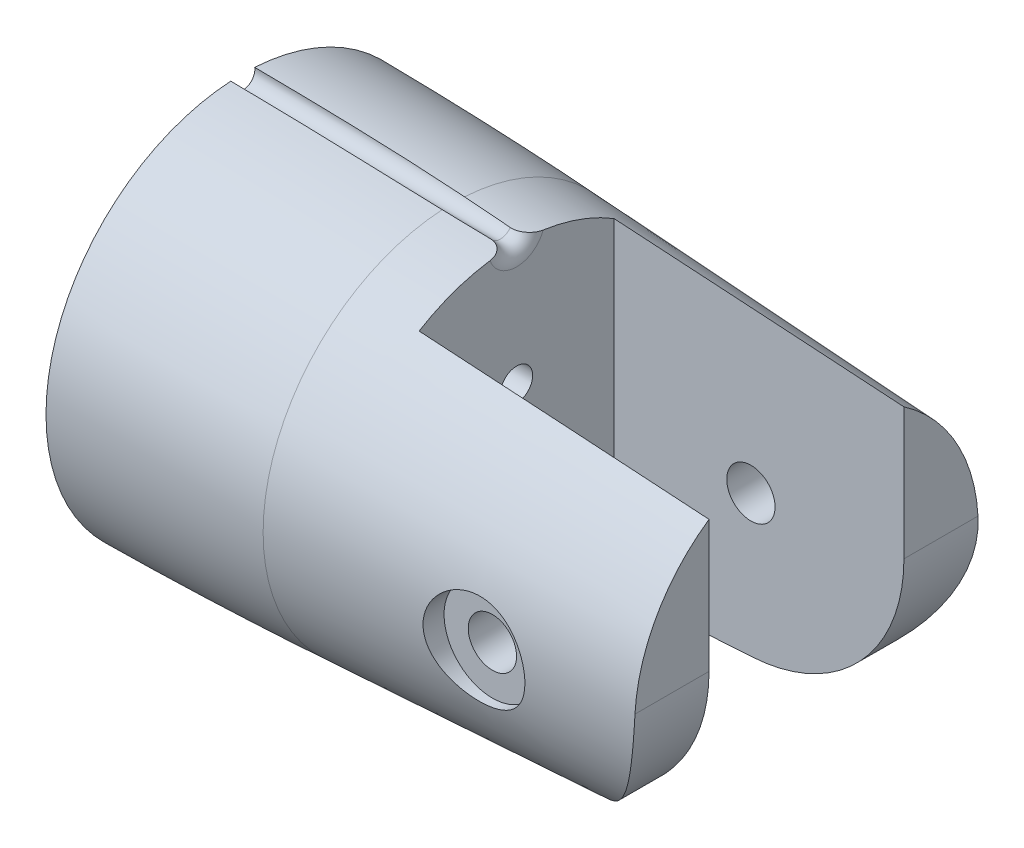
ISO-10303-21;
HEADER;
FILE_DESCRIPTION(('STEP AP214'),'2;1');
FILE_NAME('part.step','',(''),(''),'','','');
FILE_SCHEMA(('AUTOMOTIVE_DESIGN { 1 0 10303 214 1 1 1 1 }'));
ENDSEC;
DATA;
#1=APPLICATION_CONTEXT('core data for automotive mechanical design processes');
#2=APPLICATION_PROTOCOL_DEFINITION('international standard','automotive_design',2000,#1);
#3=PRODUCT_CONTEXT('',#1,'mechanical');
#4=PRODUCT('Part','Part','',(#3));
#5=PRODUCT_RELATED_PRODUCT_CATEGORY('part','',(#4));
#6=PRODUCT_DEFINITION_FORMATION('','',#4);
#7=PRODUCT_DEFINITION_CONTEXT('part definition',#1,'design');
#8=PRODUCT_DEFINITION('design','',#6,#7);
#9=PRODUCT_DEFINITION_SHAPE('','',#8);
#10=(LENGTH_UNIT() NAMED_UNIT(*) SI_UNIT(.MILLI.,.METRE.));
#11=(NAMED_UNIT(*) PLANE_ANGLE_UNIT() SI_UNIT($,.RADIAN.));
#12=(NAMED_UNIT(*) SI_UNIT($,.STERADIAN.) SOLID_ANGLE_UNIT());
#13=UNCERTAINTY_MEASURE_WITH_UNIT(LENGTH_MEASURE(1.E-05),#10,'distance_accuracy_value','');
#14=(GEOMETRIC_REPRESENTATION_CONTEXT(3) GLOBAL_UNCERTAINTY_ASSIGNED_CONTEXT((#13)) GLOBAL_UNIT_ASSIGNED_CONTEXT((#10,
#11,#12)) REPRESENTATION_CONTEXT('',''));
#15=CARTESIAN_POINT('',(0.,0.,0.));
#16=DIRECTION('',(0.,0.,1.));
#17=DIRECTION('',(1.,0.,0.));
#18=AXIS2_PLACEMENT_3D('',#15,#16,#17);
#19=CARTESIAN_POINT('',(35.,4.,0.));
#20=DIRECTION('',(-1.,0.,0.));
#21=DIRECTION('',(0.,0.,1.));
#22=AXIS2_PLACEMENT_3D('',#19,#20,#21);
#23=CYLINDRICAL_SURFACE('',#22,1.);
#24=CARTESIAN_POINT('',(17.,4.,0.));
#25=DIRECTION('',(-1.,0.,0.));
#26=DIRECTION('',(0.,0.,1.));
#27=AXIS2_PLACEMENT_3D('',#24,#25,#26);
#28=CIRCLE('',#27,1.);
#29=CARTESIAN_POINT('',(17.,4.,0.999999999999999));
#30=VERTEX_POINT('',#29);
#31=EDGE_CURVE('E466',#30,#30,#28,.F.);
#32=ORIENTED_EDGE('',*,*,#31,.T.);
#33=EDGE_LOOP('',(#32));
#34=FACE_BOUND('',#33,.T.);
#35=CARTESIAN_POINT('',(8.,4.,0.));
#36=DIRECTION('',(-1.,0.,0.));
#37=DIRECTION('',(0.,0.,1.));
#38=AXIS2_PLACEMENT_3D('',#35,#36,#37);
#39=CIRCLE('',#38,1.);
#40=CARTESIAN_POINT('',(8.,4.,0.999999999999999));
#41=VERTEX_POINT('',#40);
#42=EDGE_CURVE('E229',#41,#41,#39,.T.);
#43=ORIENTED_EDGE('',*,*,#42,.T.);
#44=EDGE_LOOP('',(#43));
#45=FACE_BOUND('',#44,.T.);
#46=ADVANCED_FACE('F34',(#34,#45),#23,.F.);
#47=CARTESIAN_POINT('',(35.,-4.,0.));
#48=DIRECTION('',(-1.,0.,0.));
#49=DIRECTION('',(0.,0.,1.));
#50=AXIS2_PLACEMENT_3D('',#47,#48,#49);
#51=CYLINDRICAL_SURFACE('',#50,1.);
#52=CARTESIAN_POINT('',(17.,-4.,0.));
#53=DIRECTION('',(-1.,0.,0.));
#54=DIRECTION('',(0.,0.,1.));
#55=AXIS2_PLACEMENT_3D('',#52,#53,#54);
#56=CIRCLE('',#55,1.);
#57=CARTESIAN_POINT('',(17.,-4.,0.999999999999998));
#58=VERTEX_POINT('',#57);
#59=EDGE_CURVE('E472',#58,#58,#56,.F.);
#60=ORIENTED_EDGE('',*,*,#59,.T.);
#61=EDGE_LOOP('',(#60));
#62=FACE_BOUND('',#61,.T.);
#63=CARTESIAN_POINT('',(8.,-4.,0.));
#64=DIRECTION('',(-1.,0.,0.));
#65=DIRECTION('',(0.,0.,1.));
#66=AXIS2_PLACEMENT_3D('',#63,#64,#65);
#67=CIRCLE('',#66,1.);
#68=CARTESIAN_POINT('',(8.,-4.,0.999999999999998));
#69=VERTEX_POINT('',#68);
#70=EDGE_CURVE('E233',#69,#69,#67,.T.);
#71=ORIENTED_EDGE('',*,*,#70,.T.);
#72=EDGE_LOOP('',(#71));
#73=FACE_BOUND('',#72,.T.);
#74=ADVANCED_FACE('F488',(#62,#73),#51,.F.);
#75=CARTESIAN_POINT('',(0.,0.,0.));
#76=DIRECTION('',(-1.,0.,0.));
#77=DIRECTION('',(0.,0.,-1.));
#78=AXIS2_PLACEMENT_3D('',#75,#76,#77);
#79=CONICAL_SURFACE('',#78,12.5,0.05235987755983);
#80=CARTESIAN_POINT('',(23.3836229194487,-2.73186884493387,10.9385378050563));
#81=CARTESIAN_POINT('',(23.5032969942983,-2.85098334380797,10.9023250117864));
#82=CARTESIAN_POINT('',(23.633048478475,-2.95999410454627,10.865965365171));
#83=CARTESIAN_POINT('',(23.909566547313,-3.15496132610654,10.7958734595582));
#84=CARTESIAN_POINT('',(24.0563403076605,-3.24090801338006,10.7621423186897));
#85=CARTESIAN_POINT('',(24.3635651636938,-3.38725375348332,10.7000988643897));
#86=CARTESIAN_POINT('',(24.5240404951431,-3.44760636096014,10.6717964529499));
#87=CARTESIAN_POINT('',(24.8540342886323,-3.54024883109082,10.6231983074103));
#88=CARTESIAN_POINT('',(25.0235486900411,-3.57255118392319,10.6028990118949));
#89=CARTESIAN_POINT('',(25.3599404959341,-3.60692804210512,10.5726271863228));
#90=CARTESIAN_POINT('',(25.5266717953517,-3.61010870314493,10.5622902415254));
#91=CARTESIAN_POINT('',(25.8586581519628,-3.58873871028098,10.5511946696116));
#92=CARTESIAN_POINT('',(26.0239134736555,-3.56419312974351,10.5504342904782));
#93=CARTESIAN_POINT('',(26.3417064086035,-3.48956723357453,10.5578039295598));
#94=CARTESIAN_POINT('',(26.4944886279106,-3.44048721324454,10.5655989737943));
#95=CARTESIAN_POINT('',(26.7898494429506,-3.31888103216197,10.5882040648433));
#96=CARTESIAN_POINT('',(26.9324269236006,-3.24635231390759,10.6030148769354));
#97=CARTESIAN_POINT('',(27.2065981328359,-3.07824916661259,10.6380872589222));
#98=CARTESIAN_POINT('',(27.3379072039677,-2.98223329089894,10.6584542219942));
#99=CARTESIAN_POINT('',(27.5830673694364,-2.77058121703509,10.7021483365));
#100=CARTESIAN_POINT('',(27.6969143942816,-2.65494045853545,10.7254761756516));
#101=CARTESIAN_POINT('',(27.9088705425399,-2.40165269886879,10.7736988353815));
#102=CARTESIAN_POINT('',(28.0061108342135,-2.26328203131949,10.7986182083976));
#103=CARTESIAN_POINT('',(28.1761230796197,-1.9719308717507,10.8465446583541));
#104=CARTESIAN_POINT('',(28.2488937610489,-1.81894962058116,10.8695516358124));
#105=CARTESIAN_POINT('',(28.368267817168,-1.50119288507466,10.9116747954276));
#106=CARTESIAN_POINT('',(28.4146651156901,-1.33633556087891,10.9307596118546));
#107=CARTESIAN_POINT('',(28.478789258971,-1.00059570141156,10.9632136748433));
#108=CARTESIAN_POINT('',(28.4965212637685,-0.829714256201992,10.9765839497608));
#109=CARTESIAN_POINT('',(28.5024745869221,-0.491370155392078,10.9965478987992));
#110=CARTESIAN_POINT('',(28.4914278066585,-0.323929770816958,11.0033037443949));
#111=CARTESIAN_POINT('',(28.4415655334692,0.0068942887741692,11.0106817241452));
#112=CARTESIAN_POINT('',(28.4027519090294,0.170278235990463,11.01130427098));
#113=CARTESIAN_POINT('',(28.2991817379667,0.486095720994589,11.0072923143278));
#114=CARTESIAN_POINT('',(28.2347784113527,0.63864631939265,11.0027278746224));
#115=CARTESIAN_POINT('',(28.0818755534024,0.930981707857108,10.9898998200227));
#116=CARTESIAN_POINT('',(27.9933738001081,1.07076531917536,10.9816358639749));
#117=CARTESIAN_POINT('',(27.793341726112,1.33564680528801,10.963160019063));
#118=CARTESIAN_POINT('',(27.6815121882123,1.46051694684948,10.9529229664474));
#119=CARTESIAN_POINT('',(27.4386301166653,1.68994964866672,10.932759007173));
#120=CARTESIAN_POINT('',(27.3075761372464,1.79451068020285,10.9228321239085));
#121=CARTESIAN_POINT('',(27.0282167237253,1.98148849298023,10.9053572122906));
#122=CARTESIAN_POINT('',(26.8797346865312,2.06364443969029,10.8978370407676));
#123=CARTESIAN_POINT('',(26.5709264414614,2.20182366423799,10.8872760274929));
#124=CARTESIAN_POINT('',(26.4106016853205,2.25785013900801,10.8842346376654));
#125=CARTESIAN_POINT('',(26.0849333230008,2.34154286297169,10.8839950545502));
#126=CARTESIAN_POINT('',(25.9196823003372,2.36956903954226,10.8867212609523));
#127=CARTESIAN_POINT('',(25.5870483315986,2.39776121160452,10.8983975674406));
#128=CARTESIAN_POINT('',(25.4196655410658,2.39792922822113,10.9073472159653));
#129=CARTESIAN_POINT('',(25.0895570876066,2.37073205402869,10.9309922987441));
#130=CARTESIAN_POINT('',(24.9267999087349,2.34368680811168,10.9456197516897));
#131=CARTESIAN_POINT('',(24.6083495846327,2.26351706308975,10.9795181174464));
#132=CARTESIAN_POINT('',(24.4526572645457,2.21038952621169,10.9987895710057));
#133=CARTESIAN_POINT('',(24.1497620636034,2.07852382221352,11.0406279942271));
#134=CARTESIAN_POINT('',(24.0027514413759,1.99936055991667,11.0632459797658));
#135=CARTESIAN_POINT('',(23.7239316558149,1.81786463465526,11.1093174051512));
#136=CARTESIAN_POINT('',(23.5921250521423,1.71552807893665,11.1327709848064));
#137=CARTESIAN_POINT('',(23.3443919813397,1.48777348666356,11.1786103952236));
#138=CARTESIAN_POINT('',(23.2288824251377,1.36189397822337,11.2009610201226));
#139=CARTESIAN_POINT('',(23.0206102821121,1.09193469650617,11.2414548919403));
#140=CARTESIAN_POINT('',(22.9278458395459,0.947856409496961,11.2595984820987));
#141=CARTESIAN_POINT('',(22.7690036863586,0.647438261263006,11.2891691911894));
#142=CARTESIAN_POINT('',(22.7025938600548,0.491282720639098,11.3006807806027));
#143=CARTESIAN_POINT('',(22.5969761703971,0.169674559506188,11.31561323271));
#144=CARTESIAN_POINT('',(22.5577602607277,0.00422470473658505,11.3190364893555));
#145=CARTESIAN_POINT('',(22.5087392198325,-0.324609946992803,11.3168619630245));
#146=CARTESIAN_POINT('',(22.4978946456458,-0.487842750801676,11.3115949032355));
#147=CARTESIAN_POINT('',(22.5027806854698,-0.813410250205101,11.2925960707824));
#148=CARTESIAN_POINT('',(22.518511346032,-0.975744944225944,11.2788642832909));
#149=CARTESIAN_POINT('',(22.575479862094,-1.29334595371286,11.2438465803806));
#150=CARTESIAN_POINT('',(22.6164688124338,-1.44866555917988,11.2226352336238));
#151=CARTESIAN_POINT('',(22.7222171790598,-1.74990876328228,11.1740158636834));
#152=CARTESIAN_POINT('',(22.786973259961,-1.89583367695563,11.1466087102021));
#153=CARTESIAN_POINT('',(22.9321823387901,-2.16370487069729,11.0898322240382));
#154=CARTESIAN_POINT('',(23.0109615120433,-2.2866356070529,11.0607961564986));
#155=CARTESIAN_POINT('',(23.1852144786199,-2.51949352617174,11.0007224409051));
#156=CARTESIAN_POINT('',(23.2806912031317,-2.62941842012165,10.969684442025));
#157=CARTESIAN_POINT('',(23.3836229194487,-2.73186884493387,10.9385378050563));
#158=B_SPLINE_CURVE_WITH_KNOTS('',3,(#80,#81,#82,#83,#84,#85,#86,#87,#88,#89,#90,#91,#92,#93,
#94,#95,#96,#97,#98,#99,#100,#101,#102,#103,#104,#105,#106,#107,#108,#109,#110,#111,#112,#113,
#114,#115,#116,#117,#118,#119,#120,#121,#122,#123,#124,#125,#126,#127,#128,#129,#130,#131,#132,
#133,#134,#135,#136,#137,#138,#139,#140,#141,#142,#143,#144,#145,#146,#147,#148,#149,#150,#151,
#152,#153,#154,#155,#156,#157),.UNSPECIFIED.,.T.,.F.,(4,2,2,2,2,2,2,2,2,2,2,2,2,2,2,2,2,2,2,2,2,
2,2,2,2,2,2,2,2,2,2,2,2,2,2,2,2,2,4),(0.,0.517556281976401,1.03533153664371,1.55404241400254,
2.07252220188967,2.57122241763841,3.06983139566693,3.54959276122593,4.02940647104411,
4.51904416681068,5.00879579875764,5.5192525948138,6.02973592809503,6.54415509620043,
7.05848165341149,7.55985630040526,8.06119721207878,8.55584588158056,9.05054017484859,
9.55201986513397,10.0535372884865,10.560665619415,11.0677318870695,11.5681928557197,
12.068617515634,12.563226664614,13.0578934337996,13.5610749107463,14.0643409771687,
14.5787659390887,15.0931489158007,15.6008265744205,16.1083539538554,16.5970083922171,
17.0856636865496,17.5695789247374,18.0534262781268,18.4984984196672,18.943648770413),.UNSPECIFIED.);
#159=CARTESIAN_POINT('',(23.3836229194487,-2.73186884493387,10.9385378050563));
#160=VERTEX_POINT('',#159);
#161=EDGE_CURVE('E475',#160,#160,#158,.T.);
#162=ORIENTED_EDGE('',*,*,#161,.F.);
#163=EDGE_LOOP('',(#162));
#164=FACE_BOUND('',#163,.T.);
#165=CARTESIAN_POINT('',(13.0801321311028,-11.7941102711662,0.69379906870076));
#166=CARTESIAN_POINT('',(13.3298579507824,-11.7813092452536,0.688541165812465));
#167=CARTESIAN_POINT('',(13.579576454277,-11.7685298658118,0.682882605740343));
#168=CARTESIAN_POINT('',(14.0787808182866,-11.743025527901,0.67070410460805));
#169=CARTESIAN_POINT('',(14.3282666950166,-11.73030053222,0.664184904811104));
#170=CARTESIAN_POINT('',(15.0764204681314,-11.6922047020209,0.643239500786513));
#171=CARTESIAN_POINT('',(15.5750535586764,-11.6668992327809,0.627419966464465));
#172=CARTESIAN_POINT('',(16.5722556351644,-11.616461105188,0.591236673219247));
#173=CARTESIAN_POINT('',(17.0708245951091,-11.5913284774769,0.570872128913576));
#174=CARTESIAN_POINT('',(17.8191464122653,-11.5537331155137,0.535651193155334));
#175=CARTESIAN_POINT('',(18.069004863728,-11.5412016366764,0.523111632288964));
#176=CARTESIAN_POINT('',(18.5686285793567,-11.5161859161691,0.496104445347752));
#177=CARTESIAN_POINT('',(18.8183938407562,-11.5037016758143,0.481636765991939));
#178=CARTESIAN_POINT('',(19.3176410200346,-11.4787898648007,0.450210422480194));
#179=CARTESIAN_POINT('',(19.5671230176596,-11.4663622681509,0.433253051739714));
#180=CARTESIAN_POINT('',(20.0658265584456,-11.4415624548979,0.395891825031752));
#181=CARTESIAN_POINT('',(20.3150481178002,-11.4291902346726,0.375488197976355));
#182=CARTESIAN_POINT('',(20.6887894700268,-11.410668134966,0.340656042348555));
#183=CARTESIAN_POINT('',(20.8135025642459,-11.4044928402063,0.328323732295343));
#184=CARTESIAN_POINT('',(21.0628385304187,-11.3921573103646,0.301685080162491));
#185=CARTESIAN_POINT('',(21.1874612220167,-11.3859970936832,0.287376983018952));
#186=CARTESIAN_POINT('',(21.3738068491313,-11.3767937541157,0.263673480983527));
#187=CARTESIAN_POINT('',(21.4356744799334,-11.3737395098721,0.255421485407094));
#188=CARTESIAN_POINT('',(21.5592888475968,-11.3676395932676,0.237911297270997));
#189=CARTESIAN_POINT('',(21.6210355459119,-11.364593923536,0.228652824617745));
#190=CARTESIAN_POINT('',(21.744207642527,-11.3585210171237,0.208724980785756));
#191=CARTESIAN_POINT('',(21.8056333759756,-11.35549376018,0.198057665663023));
#192=CARTESIAN_POINT('',(21.9280702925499,-11.3494622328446,0.174581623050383));
#193=CARTESIAN_POINT('',(21.9890817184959,-11.3464579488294,0.161774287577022));
#194=CARTESIAN_POINT('',(22.07987782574,-11.3419888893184,0.1393528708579));
#195=CARTESIAN_POINT('',(22.1100580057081,-11.3405037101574,0.131332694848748));
#196=CARTESIAN_POINT('',(22.1700645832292,-11.3375513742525,0.113542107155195));
#197=CARTESIAN_POINT('',(22.1998895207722,-11.3360842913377,0.103766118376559));
#198=CARTESIAN_POINT('',(22.2436444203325,-11.3339324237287,0.0863538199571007));
#199=CARTESIAN_POINT('',(22.2581144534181,-11.3332208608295,0.0800648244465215));
#200=CARTESIAN_POINT('',(22.2862883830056,-11.3318355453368,0.0659547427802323));
#201=CARTESIAN_POINT('',(22.2999968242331,-11.3311615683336,0.058144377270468));
#202=CARTESIAN_POINT('',(22.3160231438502,-11.330373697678,0.0459990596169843));
#203=CARTESIAN_POINT('',(22.3194601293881,-11.3302047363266,0.0431879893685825));
#204=CARTESIAN_POINT('',(22.3260046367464,-11.3298830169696,0.0371980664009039));
#205=CARTESIAN_POINT('',(22.329112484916,-11.3297302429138,0.0340195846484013));
#206=CARTESIAN_POINT('',(22.3338343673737,-11.3294981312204,0.0283349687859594));
#207=CARTESIAN_POINT('',(22.3356011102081,-11.3294112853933,0.0259576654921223));
#208=CARTESIAN_POINT('',(22.3387756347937,-11.3292552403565,0.0209714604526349));
#209=CARTESIAN_POINT('',(22.3401840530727,-11.3291860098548,0.0183629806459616));
#210=CARTESIAN_POINT('',(22.3422099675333,-11.3290864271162,0.0135892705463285));
#211=CARTESIAN_POINT('',(22.34293659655,-11.3290507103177,0.0114711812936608));
#212=CARTESIAN_POINT('',(22.3440286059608,-11.3289970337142,0.00714396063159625));
#213=CARTESIAN_POINT('',(22.3443945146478,-11.3289790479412,0.00493496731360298));
#214=CARTESIAN_POINT('',(22.344722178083,-11.3289629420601,0.00047563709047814));
#215=CARTESIAN_POINT('',(22.3446820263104,-11.3289649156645,-0.00177484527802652));
#216=CARTESIAN_POINT('',(22.344198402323,-11.3289886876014,-0.00623228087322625));
#217=CARTESIAN_POINT('',(22.3437545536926,-11.3290105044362,-0.00843919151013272));
#218=CARTESIAN_POINT('',(22.342382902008,-11.3290779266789,-0.01321238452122));
#219=CARTESIAN_POINT('',(22.341371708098,-11.329127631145,-0.0157542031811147));
#220=CARTESIAN_POINT('',(22.3389584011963,-11.329246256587,-0.0206432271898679));
#221=CARTESIAN_POINT('',(22.3375554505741,-11.3293152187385,-0.0229900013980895));
#222=CARTESIAN_POINT('',(22.3333546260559,-11.3295217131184,-0.0291257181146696));
#223=CARTESIAN_POINT('',(22.3302836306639,-11.329672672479,-0.0327243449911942));
#224=CARTESIAN_POINT('',(22.3236768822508,-11.3299974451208,-0.0394603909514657));
#225=CARTESIAN_POINT('',(22.3201396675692,-11.330171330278,-0.0425962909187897));
#226=CARTESIAN_POINT('',(22.3048491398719,-11.3309230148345,-0.0549814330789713));
#227=CARTESIAN_POINT('',(22.2919225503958,-11.3315585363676,-0.0627307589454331));
#228=CARTESIAN_POINT('',(22.2652791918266,-11.332868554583,-0.0767050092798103));
#229=CARTESIAN_POINT('',(22.2515573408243,-11.3335433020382,-0.0829183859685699));
#230=CARTESIAN_POINT('',(22.2055810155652,-11.3358043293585,-0.10196314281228));
#231=CARTESIAN_POINT('',(22.1725178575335,-11.3374306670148,-0.112845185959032));
#232=CARTESIAN_POINT('',(22.105780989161,-11.3407141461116,-0.132571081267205));
#233=CARTESIAN_POINT('',(22.0721058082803,-11.342371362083,-0.141409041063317));
#234=CARTESIAN_POINT('',(22.0044433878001,-11.3457019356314,-0.157781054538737));
#235=CARTESIAN_POINT('',(21.9704562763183,-11.3473752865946,-0.165315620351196));
#236=CARTESIAN_POINT('',(21.9023571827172,-11.3507289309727,-0.179506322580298));
#237=CARTESIAN_POINT('',(21.8682454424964,-11.3524092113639,-0.186163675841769));
#238=CARTESIAN_POINT('',(21.7662910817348,-11.3574324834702,-0.205087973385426));
#239=CARTESIAN_POINT('',(21.6982771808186,-11.3607850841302,-0.216430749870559));
#240=CARTESIAN_POINT('',(21.5620092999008,-11.3675052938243,-0.237578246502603));
#241=CARTESIAN_POINT('',(21.4937552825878,-11.3708729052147,-0.247382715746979));
#242=CARTESIAN_POINT('',(21.2886496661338,-11.3809974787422,-0.275201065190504));
#243=CARTESIAN_POINT('',(21.1515805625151,-11.3877699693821,-0.291598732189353));
#244=CARTESIAN_POINT('',(20.8773434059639,-11.4013326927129,-0.32183881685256));
#245=CARTESIAN_POINT('',(20.7401756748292,-11.4081228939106,-0.335684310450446));
#246=CARTESIAN_POINT('',(20.4657367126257,-11.4217212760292,-0.36158328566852));
#247=CARTESIAN_POINT('',(20.328465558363,-11.4285294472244,-0.373637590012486));
#248=CARTESIAN_POINT('',(19.9003855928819,-11.4497807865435,-0.409175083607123));
#249=CARTESIAN_POINT('',(19.609391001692,-11.4642555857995,-0.430379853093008));
#250=CARTESIAN_POINT('',(19.0271548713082,-11.4932753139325,-0.46908478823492));
#251=CARTESIAN_POINT('',(18.7359133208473,-11.5078202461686,-0.486584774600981));
#252=CARTESIAN_POINT('',(18.1531930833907,-11.5369798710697,-0.518868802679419));
#253=CARTESIAN_POINT('',(17.8617143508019,-11.5515945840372,-0.533651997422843));
#254=CARTESIAN_POINT('',(17.2786673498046,-11.58088648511,-0.56108537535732));
#255=CARTESIAN_POINT('',(16.9870990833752,-11.5955636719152,-0.573735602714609));
#256=CARTESIAN_POINT('',(16.1122035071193,-11.6396918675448,-0.609071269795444));
#257=CARTESIAN_POINT('',(15.5287749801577,-11.6692350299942,-0.629137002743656));
#258=CARTESIAN_POINT('',(14.3618389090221,-11.7285576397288,-0.663994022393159));
#259=CARTESIAN_POINT('',(13.7783313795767,-11.7583370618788,-0.678785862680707));
#260=CARTESIAN_POINT('',(13.1565671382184,-11.7901926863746,-0.69218085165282));
#261=CARTESIAN_POINT('',(13.1183497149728,-11.7921512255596,-0.692994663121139));
#262=CARTESIAN_POINT('',(13.0801321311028,-11.7941102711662,-0.693799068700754));
#263=B_SPLINE_CURVE_WITH_KNOTS('',3,(#165,#166,#167,#168,#169,#170,#171,#172,#173,#174,#175,
#176,#177,#178,#179,#180,#181,#182,#183,#184,#185,#186,#187,#188,#189,#190,#191,#192,#193,#194,
#195,#196,#197,#198,#199,#200,#201,#202,#203,#204,#205,#206,#207,#208,#209,#210,#211,#212,#213,
#214,#215,#216,#217,#218,#219,#220,#221,#222,#223,#224,#225,#226,#227,#228,#229,#230,#231,#232,
#233,#234,#235,#236,#237,#238,#239,#240,#241,#242,#243,#244,#245,#246,#247,#248,#249,#250,#251,
#252,#253,#254,#255,#256,#257,#258,#259,#260,#261,#262),.UNSPECIFIED.,.F.,.F.,(4,2,2,2,2,2,2,2,
2,2,2,2,2,2,2,2,2,2,2,2,2,2,2,2,2,2,2,2,2,2,2,2,2,2,2,2,2,2,2,2,2,2,2,2,2,2,2,2,4),(0.,
0.750326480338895,1.50001087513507,2.99857130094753,4.49739088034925,5.24884534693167,
6.000320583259,6.7514067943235,7.5024431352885,7.87885493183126,8.25560326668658,
8.44306926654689,8.63058757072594,8.81783517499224,9.00496145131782,9.09874490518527,
9.19283169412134,9.2402073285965,9.28726046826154,9.30057327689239,9.31387275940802,
9.32274108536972,9.33159354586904,9.33828605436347,9.34496874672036,9.35168282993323,
9.35840317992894,9.36656514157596,9.37474469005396,9.38886426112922,9.4030292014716,
9.44793060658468,9.49315997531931,9.59743390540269,9.70200477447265,9.80653446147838,
9.91091758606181,10.1179855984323,10.3250873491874,10.7396745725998,11.1537588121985,
11.5676522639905,12.4439837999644,13.320357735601,14.1970044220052,15.0736329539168,
16.8271593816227,18.5805016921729,18.6953303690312),.UNSPECIFIED.);
#264=CARTESIAN_POINT('',(13.0803321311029,-11.7941000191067,0.693794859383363));
#265=VERTEX_POINT('',#264);
#266=CARTESIAN_POINT('',(16.,-11.6454062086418,0.611985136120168));
#267=VERTEX_POINT('',#266);
#268=EDGE_CURVE('E241',#265,#267,#263,.T.);
#269=ORIENTED_EDGE('',*,*,#268,.T.);
#270=CARTESIAN_POINT('',(16.,-11.6454062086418,0.611985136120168));
#271=CARTESIAN_POINT('',(16.0244082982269,-11.6441710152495,0.611105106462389));
#272=CARTESIAN_POINT('',(16.0488415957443,-11.6428797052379,0.611285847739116));
#273=CARTESIAN_POINT('',(16.0975845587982,-11.6401914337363,0.613764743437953));
#274=CARTESIAN_POINT('',(16.1218942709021,-11.6387945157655,0.616062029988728));
#275=CARTESIAN_POINT('',(16.1940912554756,-11.634472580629,0.6260788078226));
#276=CARTESIAN_POINT('',(16.2415702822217,-11.6314000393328,0.636911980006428));
#277=CARTESIAN_POINT('',(16.3339711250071,-11.6249097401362,0.666176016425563));
#278=CARTESIAN_POINT('',(16.3788962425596,-11.6214924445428,0.684596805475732));
#279=CARTESIAN_POINT('',(16.4654584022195,-11.6143062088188,0.728042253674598));
#280=CARTESIAN_POINT('',(16.5070901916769,-11.6105367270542,0.753077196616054));
#281=CARTESIAN_POINT('',(16.5902966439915,-11.6022318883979,0.811548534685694));
#282=CARTESIAN_POINT('',(16.6314531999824,-11.59765764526,0.845573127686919));
#283=CARTESIAN_POINT('',(16.7082179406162,-11.5880093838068,0.919320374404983));
#284=CARTESIAN_POINT('',(16.7438246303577,-11.5829352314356,0.959044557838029));
#285=CARTESIAN_POINT('',(16.8128280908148,-11.5715772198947,1.04841020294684));
#286=CARTESIAN_POINT('',(16.8454155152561,-11.5652213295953,1.09867048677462));
#287=CARTESIAN_POINT('',(16.9018470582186,-11.5517802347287,1.20378423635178));
#288=CARTESIAN_POINT('',(16.9256923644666,-11.5446951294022,1.2586370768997));
#289=CARTESIAN_POINT('',(16.962899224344,-11.5301867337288,1.36868361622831));
#290=CARTESIAN_POINT('',(16.9767214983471,-11.5227975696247,1.42372589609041));
#291=CARTESIAN_POINT('',(16.995297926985,-11.5074867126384,1.53531426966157));
#292=CARTESIAN_POINT('',(17.0000406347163,-11.4995643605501,1.59186217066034));
#293=CARTESIAN_POINT('',(17.,-11.4914378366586,1.64842668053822));
#294=B_SPLINE_CURVE_WITH_KNOTS('',3,(#270,#271,#272,#273,#274,#275,#276,#277,#278,#279,#280,
#281,#282,#283,#284,#285,#286,#287,#288,#289,#290,#291,#292,#293),.UNSPECIFIED.,.F.,.F.,(4,2,2,
2,2,2,2,2,2,2,2,4),(0.,0.0733223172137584,0.146614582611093,0.29223889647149,0.437670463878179,
0.583329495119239,0.743486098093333,0.903685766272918,1.08357293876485,1.26343566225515,
1.43439071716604,1.60556115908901),.UNSPECIFIED.);
#295=CARTESIAN_POINT('',(17.,-11.4914378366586,1.64842668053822));
#296=VERTEX_POINT('',#295);
#297=EDGE_CURVE('E532',#267,#296,#294,.T.);
#298=ORIENTED_EDGE('',*,*,#297,.T.);
#299=CARTESIAN_POINT('',(17.,0.,0.));
#300=DIRECTION('',(-1.,0.,0.));
#301=DIRECTION('',(0.,0.,1.));
#302=AXIS2_PLACEMENT_3D('',#299,#300,#301);
#303=CIRCLE('',#302,11.6090677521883);
#304=CARTESIAN_POINT('',(17.,-9.90797426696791,6.05));
#305=VERTEX_POINT('',#304);
#306=EDGE_CURVE('E455',#296,#305,#303,.T.);
#307=ORIENTED_EDGE('',*,*,#306,.T.);
#308=CARTESIAN_POINT('',(26.0000000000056,-9.3458901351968,0.));
#309=DIRECTION('',(-0.0623323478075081,0.998055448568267,0.));
#310=DIRECTION('',(-0.998055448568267,-0.0623323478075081,0.));
#311=AXIS2_PLACEMENT_3D('',#308,#309,#310);
#312=ELLIPSE('',#311,178.677655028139,6.057719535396);
#313=CARTESIAN_POINT('',(25.6233234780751,-9.36941501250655,6.05770602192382));
#314=VERTEX_POINT('',#313);
#315=EDGE_CURVE('E836',#305,#314,#312,.T.);
#316=ORIENTED_EDGE('',*,*,#315,.T.);
#317=CARTESIAN_POINT('',(25.6231234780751,-9.36942750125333,6.05770601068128));
#318=CARTESIAN_POINT('',(25.8031203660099,-9.35823356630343,6.05757431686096));
#319=CARTESIAN_POINT('',(25.9827020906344,-9.34209174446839,6.0652692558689));
#320=CARTESIAN_POINT('',(26.3391777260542,-9.30039397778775,6.09503567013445));
#321=CARTESIAN_POINT('',(26.5160767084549,-9.27485896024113,6.11707526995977));
#322=CARTESIAN_POINT('',(26.863555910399,-9.21524621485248,6.17384268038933));
#323=CARTESIAN_POINT('',(27.0341908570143,-9.18130014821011,6.20837840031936));
#324=CARTESIAN_POINT('',(27.3710804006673,-9.105228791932,6.28840388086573));
#325=CARTESIAN_POINT('',(27.5373321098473,-9.06309825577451,6.33390067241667));
#326=CARTESIAN_POINT('',(27.9358016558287,-8.95131261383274,6.4556494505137));
#327=CARTESIAN_POINT('',(28.1654288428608,-8.87763650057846,6.53669010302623));
#328=CARTESIAN_POINT('',(28.6141797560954,-8.71595305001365,6.7122984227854));
#329=CARTESIAN_POINT('',(28.8332990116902,-8.62793968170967,6.80687178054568));
#330=CARTESIAN_POINT('',(29.2630512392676,-8.43773140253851,7.00609455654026));
#331=CARTESIAN_POINT('',(29.4735981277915,-8.3354242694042,7.11082147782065));
#332=CARTESIAN_POINT('',(29.8846318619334,-8.11780332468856,7.32617727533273));
#333=CARTESIAN_POINT('',(30.085119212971,-8.00249016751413,7.43680585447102));
#334=CARTESIAN_POINT('',(30.5439984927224,-7.71713777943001,7.69992967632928));
#335=CARTESIAN_POINT('',(30.7984795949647,-7.5419508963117,7.85369067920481));
#336=CARTESIAN_POINT('',(31.290212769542,-7.16886517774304,8.16140937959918));
#337=CARTESIAN_POINT('',(31.5274589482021,-6.97095863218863,8.31536712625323));
#338=CARTESIAN_POINT('',(31.9834086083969,-6.55316737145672,8.61843071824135));
#339=CARTESIAN_POINT('',(32.2021692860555,-6.33335540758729,8.76755057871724));
#340=CARTESIAN_POINT('',(32.620700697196,-5.87129848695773,9.05733124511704));
#341=CARTESIAN_POINT('',(32.8204792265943,-5.62906282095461,9.19799551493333));
#342=CARTESIAN_POINT('',(33.1516329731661,-5.18601401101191,9.43317859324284));
#343=CARTESIAN_POINT('',(33.2875935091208,-4.99005903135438,9.53041971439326));
#344=CARTESIAN_POINT('',(33.5467595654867,-4.58602099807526,9.71627291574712));
#345=CARTESIAN_POINT('',(33.6699681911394,-4.37794091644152,9.80488709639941));
#346=CARTESIAN_POINT('',(33.9025114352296,-3.95006598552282,9.97184402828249));
#347=CARTESIAN_POINT('',(34.0118402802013,-3.73026631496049,10.0501825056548));
#348=CARTESIAN_POINT('',(34.2152550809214,-3.27989026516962,10.1948492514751));
#349=CARTESIAN_POINT('',(34.3093415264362,-3.04931423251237,10.2611779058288));
#350=CARTESIAN_POINT('',(34.4818452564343,-2.57612951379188,10.3808215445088));
#351=CARTESIAN_POINT('',(34.5600858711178,-2.33341918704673,10.4339911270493));
#352=CARTESIAN_POINT('',(34.6983416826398,-1.83994530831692,10.5248635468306));
#353=CARTESIAN_POINT('',(34.7583532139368,-1.5891801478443,10.5625632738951));
#354=CARTESIAN_POINT('',(34.8588895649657,-1.08261155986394,10.6211266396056));
#355=CARTESIAN_POINT('',(34.8994710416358,-0.826825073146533,10.6420393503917));
#356=CARTESIAN_POINT('',(34.9606458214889,-0.312200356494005,10.6663258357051));
#357=CARTESIAN_POINT('',(34.9812578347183,-0.0533652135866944,10.6697160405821));
#358=CARTESIAN_POINT('',(34.9945193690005,0.27322133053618,10.6627307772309));
#359=CARTESIAN_POINT('',(34.9965774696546,0.340901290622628,10.6606733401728));
#360=CARTESIAN_POINT('',(34.9993173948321,0.476175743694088,10.6553430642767));
#361=CARTESIAN_POINT('',(35.0000005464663,0.543770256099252,10.6520714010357));
#362=CARTESIAN_POINT('',(34.999999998,0.611339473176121,10.6481928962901));
#363=B_SPLINE_CURVE_WITH_KNOTS('',3,(#317,#318,#319,#320,#321,#322,#323,#324,#325,#326,#327,
#328,#329,#330,#331,#332,#333,#334,#335,#336,#337,#338,#339,#340,#341,#342,#343,#344,#345,#346,
#347,#348,#349,#350,#351,#352,#353,#354,#355,#356,#357,#358,#359,#360,#361,#362),.UNSPECIFIED.,
.F.,.F.,(4,2,2,2,2,2,2,2,2,2,2,2,2,2,2,2,2,2,2,2,2,2,4),(0.,0.540636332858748,1.08007539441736,
1.61155188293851,2.14337019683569,2.90535409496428,3.66765935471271,4.43632643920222,
5.20495486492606,6.23899785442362,7.27339279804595,8.30446012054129,9.33510213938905,
10.1071285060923,10.8789664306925,11.6511243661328,12.423257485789,13.2035754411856,
13.9840502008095,14.7622350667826,15.5396901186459,15.7429023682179,15.9459183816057),.UNSPECIFIED.);
#364=CARTESIAN_POINT('',(35.,0.611139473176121,10.6482043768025));
#365=VERTEX_POINT('',#364);
#366=EDGE_CURVE('E398',#314,#365,#363,.T.);
#367=ORIENTED_EDGE('',*,*,#366,.T.);
#368=CARTESIAN_POINT('',(35.,0.,0.));
#369=DIRECTION('',(1.,0.,0.));
#370=DIRECTION('',(0.,0.,-1.));
#371=AXIS2_PLACEMENT_3D('',#368,#369,#370);
#372=CIRCLE('',#371,10.6657277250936);
#373=CARTESIAN_POINT('',(35.,8.78380600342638,6.05));
#374=VERTEX_POINT('',#373);
#375=EDGE_CURVE('E444',#374,#365,#372,.T.);
#376=ORIENTED_EDGE('',*,*,#375,.F.);
#377=CARTESIAN_POINT('',(-0.0578929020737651,10.9418170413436,6.05));
#378=CARTESIAN_POINT('',(3.53792488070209,10.7264454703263,6.05));
#379=CARTESIAN_POINT('',(7.13365867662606,10.5096553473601,6.05));
#380=CARTESIAN_POINT('',(14.3249325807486,10.0724937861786,6.05));
#381=CARTESIAN_POINT('',(17.9204726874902,9.85212232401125,6.05));
#382=CARTESIAN_POINT('',(23.3135826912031,9.51832310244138,6.05));
#383=CARTESIAN_POINT('',(25.1112529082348,9.40651634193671,6.05));
#384=CARTESIAN_POINT('',(28.7065163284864,9.1816939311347,6.05));
#385=CARTESIAN_POINT('',(30.5041095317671,9.0686782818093,6.05));
#386=CARTESIAN_POINT('',(34.0991996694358,8.8412986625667,6.05));
#387=CARTESIAN_POINT('',(35.8966966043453,8.72693470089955,6.05));
#388=CARTESIAN_POINT('',(39.4915983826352,8.49668908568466,6.05));
#389=CARTESIAN_POINT('',(41.2890032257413,8.38080742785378,6.05));
#390=CARTESIAN_POINT('',(45.5354204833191,8.1050008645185,6.05));
#391=CARTESIAN_POINT('',(47.9843852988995,7.94434185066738,6.05));
#392=CARTESIAN_POINT('',(52.8820614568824,7.61921955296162,6.05));
#393=CARTESIAN_POINT('',(55.3307727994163,7.45475627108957,6.05));
#394=CARTESIAN_POINT('',(60.2278527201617,7.12120542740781,6.05));
#395=CARTESIAN_POINT('',(62.6762213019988,6.9521179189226,6.05));
#396=CARTESIAN_POINT('',(67.5725633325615,6.60820931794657,6.05));
#397=CARTESIAN_POINT('',(70.0205367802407,6.43338821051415,6.05));
#398=CARTESIAN_POINT('',(74.9161051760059,6.07644452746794,6.05));
#399=CARTESIAN_POINT('',(77.3637000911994,5.89432149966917,6.04999999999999));
#400=CARTESIAN_POINT('',(82.2581494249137,5.52053856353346,6.04999999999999));
#401=CARTESIAN_POINT('',(84.7050038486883,5.32887872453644,6.04999999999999));
#402=CARTESIAN_POINT('',(88.3745461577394,5.0315242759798,6.04999999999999));
#403=CARTESIAN_POINT('',(89.597633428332,4.93075944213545,6.04999999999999));
#404=CARTESIAN_POINT('',(92.0434723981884,4.72526252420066,6.04999999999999));
#405=CARTESIAN_POINT('',(93.2662240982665,4.62053044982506,6.04999999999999));
#406=CARTESIAN_POINT('',(95.711335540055,4.40623027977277,6.04999999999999));
#407=CARTESIAN_POINT('',(96.933695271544,4.29666206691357,6.04999999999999));
#408=CARTESIAN_POINT('',(98.7668208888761,4.12776224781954,6.04999999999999));
#409=CARTESIAN_POINT('',(99.3777963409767,4.07070414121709,6.04999999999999));
#410=CARTESIAN_POINT('',(100.599584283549,3.9548577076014,6.04999999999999));
#411=CARTESIAN_POINT('',(101.210396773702,3.89606937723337,6.04999999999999));
#412=CARTESIAN_POINT('',(101.821114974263,3.83630878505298,6.04999999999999));
#413=B_SPLINE_CURVE_WITH_KNOTS('',3,(#377,#378,#379,#380,#381,#382,#383,#384,#385,#386,#387,
#388,#389,#390,#391,#392,#393,#394,#395,#396,#397,#398,#399,#400,#401,#402,#403,#404,#405,#406,
#407,#408,#409,#410,#411,#412),.UNSPECIFIED.,.F.,.F.,(4,2,2,2,2,2,2,2,2,2,2,2,2,2,2,2,2,4),(0.,
10.8067868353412,21.6136459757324,27.0170769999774,32.4205036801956,37.8238973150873,
43.2273062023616,50.5899906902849,57.952671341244,65.3152671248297,72.6778820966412,
80.0409537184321,87.4039718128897,91.0856598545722,94.7673388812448,98.4491071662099,
100.290006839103,102.130910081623),.UNSPECIFIED.);
#414=CARTESIAN_POINT('',(17.,9.90797426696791,6.05));
#415=VERTEX_POINT('',#414);
#416=EDGE_CURVE('E430',#374,#415,#413,.F.);
#417=ORIENTED_EDGE('',*,*,#416,.T.);
#418=CARTESIAN_POINT('',(17.,11.4914378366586,1.64842668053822));
#419=VERTEX_POINT('',#418);
#420=EDGE_CURVE('E452',#415,#419,#303,.T.);
#421=ORIENTED_EDGE('',*,*,#420,.T.);
#422=CARTESIAN_POINT('',(17.,11.4914378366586,1.64842668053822));
#423=CARTESIAN_POINT('',(17.0000001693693,11.495692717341,1.61877001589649));
#424=CARTESIAN_POINT('',(16.9987059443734,11.4998961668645,1.58912218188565));
#425=CARTESIAN_POINT('',(16.9935662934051,11.5081777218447,1.53003777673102));
#426=CARTESIAN_POINT('',(16.9897214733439,11.51225585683,1.50060115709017));
#427=CARTESIAN_POINT('',(16.9744486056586,11.5242464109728,1.41306099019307));
#428=CARTESIAN_POINT('',(16.9592816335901,11.5319419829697,1.35553844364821));
#429=CARTESIAN_POINT('',(16.91958184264,11.5466222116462,1.24379450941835));
#430=CARTESIAN_POINT('',(16.8950524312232,11.5536071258,1.18957192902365));
#431=CARTESIAN_POINT('',(16.8373998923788,11.5668595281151,1.08576200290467));
#432=CARTESIAN_POINT('',(16.8042712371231,11.5731265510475,1.03617766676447));
#433=CARTESIAN_POINT('',(16.7293067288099,11.5851397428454,0.941753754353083));
#434=CARTESIAN_POINT('',(16.6872581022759,11.5908670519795,0.897080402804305));
#435=CARTESIAN_POINT('',(16.5960194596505,11.6016818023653,0.815559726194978));
#436=CARTESIAN_POINT('',(16.5468268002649,11.6067690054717,0.778715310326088));
#437=CARTESIAN_POINT('',(16.4437273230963,11.6162534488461,0.715424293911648));
#438=CARTESIAN_POINT('',(16.3899663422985,11.6206645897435,0.688744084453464));
#439=CARTESIAN_POINT('',(16.2782593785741,11.6289535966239,0.64653744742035));
#440=CARTESIAN_POINT('',(16.2203273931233,11.6328331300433,0.630975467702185));
#441=CARTESIAN_POINT('',(16.1347962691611,11.6380418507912,0.617491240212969));
#442=CARTESIAN_POINT('',(16.1079321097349,11.6396056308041,0.614576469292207));
#443=CARTESIAN_POINT('',(16.0540362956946,11.6426044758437,0.611336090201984));
#444=CARTESIAN_POINT('',(16.0270046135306,11.6440395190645,0.611010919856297));
#445=CARTESIAN_POINT('',(16.,11.6454062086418,0.611985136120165));
#446=B_SPLINE_CURVE_WITH_KNOTS('',3,(#422,#423,#424,#425,#426,#427,#428,#429,#430,#431,#432,
#433,#434,#435,#436,#437,#438,#439,#440,#441,#442,#443,#444,#445),.UNSPECIFIED.,.F.,.F.,(4,2,2,
2,2,2,2,2,2,2,2,4),(0.,0.0898222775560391,0.17962322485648,0.358660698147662,0.537633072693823,
0.716720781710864,0.900691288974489,1.08473003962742,1.2642388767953,1.44317110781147,
1.52426383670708,1.60537027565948),.UNSPECIFIED.);
#447=CARTESIAN_POINT('',(16.,11.6454062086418,0.61198513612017));
#448=VERTEX_POINT('',#447);
#449=EDGE_CURVE('E542',#419,#448,#446,.T.);
#450=ORIENTED_EDGE('',*,*,#449,.T.);
#451=CARTESIAN_POINT('',(13.0801321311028,11.7941102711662,-0.693799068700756));
#452=CARTESIAN_POINT('',(13.3298579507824,11.7813092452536,-0.688541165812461));
#453=CARTESIAN_POINT('',(13.579576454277,11.7685298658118,-0.682882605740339));
#454=CARTESIAN_POINT('',(14.0787808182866,11.743025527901,-0.670704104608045));
#455=CARTESIAN_POINT('',(14.3282666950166,11.73030053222,-0.6641849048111));
#456=CARTESIAN_POINT('',(15.0764204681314,11.6922047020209,-0.643239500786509));
#457=CARTESIAN_POINT('',(15.5750535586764,11.6668992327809,-0.627419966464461));
#458=CARTESIAN_POINT('',(16.5722556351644,11.616461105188,-0.591236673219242));
#459=CARTESIAN_POINT('',(17.0708245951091,11.5913284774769,-0.57087212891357));
#460=CARTESIAN_POINT('',(17.8191464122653,11.5537331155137,-0.53565119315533));
#461=CARTESIAN_POINT('',(18.069004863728,11.5412016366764,-0.523111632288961));
#462=CARTESIAN_POINT('',(18.5686285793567,11.5161859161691,-0.49610444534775));
#463=CARTESIAN_POINT('',(18.8183938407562,11.5037016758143,-0.481636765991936));
#464=CARTESIAN_POINT('',(19.3176410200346,11.4787898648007,-0.450210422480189));
#465=CARTESIAN_POINT('',(19.5671230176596,11.4663622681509,-0.43325305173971));
#466=CARTESIAN_POINT('',(20.0658265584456,11.4415624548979,-0.395891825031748));
#467=CARTESIAN_POINT('',(20.3150481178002,11.4291902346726,-0.375488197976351));
#468=CARTESIAN_POINT('',(20.6887894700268,11.410668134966,-0.340656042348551));
#469=CARTESIAN_POINT('',(20.8135025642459,11.4044928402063,-0.328323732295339));
#470=CARTESIAN_POINT('',(21.0628385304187,11.3921573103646,-0.301685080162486));
#471=CARTESIAN_POINT('',(21.1874612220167,11.3859970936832,-0.287376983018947));
#472=CARTESIAN_POINT('',(21.3738068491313,11.3767937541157,-0.263673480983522));
#473=CARTESIAN_POINT('',(21.4356744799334,11.3737395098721,-0.25542148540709));
#474=CARTESIAN_POINT('',(21.5592888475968,11.3676395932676,-0.237911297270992));
#475=CARTESIAN_POINT('',(21.6210355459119,11.364593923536,-0.228652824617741));
#476=CARTESIAN_POINT('',(21.744207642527,11.3585210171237,-0.20872498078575));
#477=CARTESIAN_POINT('',(21.8056333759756,11.35549376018,-0.198057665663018));
#478=CARTESIAN_POINT('',(21.9280702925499,11.3494622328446,-0.174581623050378));
#479=CARTESIAN_POINT('',(21.9890817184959,11.3464579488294,-0.161774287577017));
#480=CARTESIAN_POINT('',(22.07987782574,11.3419888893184,-0.139352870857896));
#481=CARTESIAN_POINT('',(22.1100580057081,11.3405037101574,-0.131332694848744));
#482=CARTESIAN_POINT('',(22.1700645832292,11.3375513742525,-0.113542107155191));
#483=CARTESIAN_POINT('',(22.1998895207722,11.3360842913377,-0.103766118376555));
#484=CARTESIAN_POINT('',(22.2436444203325,11.3339324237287,-0.0863538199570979));
#485=CARTESIAN_POINT('',(22.2581144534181,11.3332208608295,-0.0800648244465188));
#486=CARTESIAN_POINT('',(22.2862883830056,11.3318355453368,-0.065954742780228));
#487=CARTESIAN_POINT('',(22.2999968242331,11.3311615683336,-0.0581443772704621));
#488=CARTESIAN_POINT('',(22.3160231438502,11.330373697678,-0.0459990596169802));
#489=CARTESIAN_POINT('',(22.3194601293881,11.3302047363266,-0.0431879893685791));
#490=CARTESIAN_POINT('',(22.3260046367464,11.3298830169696,-0.0371980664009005));
#491=CARTESIAN_POINT('',(22.329112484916,11.3297302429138,-0.034019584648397));
#492=CARTESIAN_POINT('',(22.3338343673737,11.3294981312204,-0.0283349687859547));
#493=CARTESIAN_POINT('',(22.3356011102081,11.3294112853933,-0.0259576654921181));
#494=CARTESIAN_POINT('',(22.3387756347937,11.3292552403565,-0.0209714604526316));
#495=CARTESIAN_POINT('',(22.3401840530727,11.3291860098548,-0.0183629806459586));
#496=CARTESIAN_POINT('',(22.3422099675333,11.3290864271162,-0.0135892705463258));
#497=CARTESIAN_POINT('',(22.34293659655,11.3290507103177,-0.0114711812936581));
#498=CARTESIAN_POINT('',(22.3440286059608,11.3289970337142,-0.00714396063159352));
#499=CARTESIAN_POINT('',(22.3443945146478,11.3289790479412,-0.00493496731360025));
#500=CARTESIAN_POINT('',(22.344722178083,11.3289629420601,-0.000475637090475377));
#501=CARTESIAN_POINT('',(22.3446820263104,11.3289649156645,0.00177484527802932));
#502=CARTESIAN_POINT('',(22.344198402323,11.3289886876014,0.00623228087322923));
#503=CARTESIAN_POINT('',(22.3437545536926,11.3290105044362,0.00843919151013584));
#504=CARTESIAN_POINT('',(22.342382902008,11.3290779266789,0.0132123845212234));
#505=CARTESIAN_POINT('',(22.341371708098,11.329127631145,0.0157542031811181));
#506=CARTESIAN_POINT('',(22.3389584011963,11.329246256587,0.0206432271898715));
#507=CARTESIAN_POINT('',(22.3375554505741,11.3293152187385,0.0229900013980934));
#508=CARTESIAN_POINT('',(22.3333546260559,11.3295217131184,0.0291257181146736));
#509=CARTESIAN_POINT('',(22.3302836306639,11.329672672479,0.0327243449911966));
#510=CARTESIAN_POINT('',(22.3236768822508,11.3299974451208,0.039460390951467));
#511=CARTESIAN_POINT('',(22.3201396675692,11.330171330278,0.0425962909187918));
#512=CARTESIAN_POINT('',(22.3048491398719,11.3309230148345,0.0549814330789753));
#513=CARTESIAN_POINT('',(22.2919225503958,11.3315585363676,0.0627307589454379));
#514=CARTESIAN_POINT('',(22.2652791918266,11.332868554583,0.0767050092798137));
#515=CARTESIAN_POINT('',(22.2515573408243,11.3335433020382,0.0829183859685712));
#516=CARTESIAN_POINT('',(22.2055810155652,11.3358043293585,0.101963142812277));
#517=CARTESIAN_POINT('',(22.1725178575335,11.3374306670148,0.11284518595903));
#518=CARTESIAN_POINT('',(22.105780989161,11.3407141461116,0.132571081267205));
#519=CARTESIAN_POINT('',(22.0721058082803,11.342371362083,0.141409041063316));
#520=CARTESIAN_POINT('',(22.0044433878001,11.3457019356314,0.157781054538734));
#521=CARTESIAN_POINT('',(21.9704562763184,11.3473752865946,0.165315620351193));
#522=CARTESIAN_POINT('',(21.9023571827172,11.3507289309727,0.179506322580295));
#523=CARTESIAN_POINT('',(21.8682454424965,11.3524092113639,0.186163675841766));
#524=CARTESIAN_POINT('',(21.7662910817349,11.3574324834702,0.205087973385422));
#525=CARTESIAN_POINT('',(21.6982771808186,11.3607850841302,0.216430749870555));
#526=CARTESIAN_POINT('',(21.5620092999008,11.3675052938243,0.237578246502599));
#527=CARTESIAN_POINT('',(21.4937552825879,11.3708729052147,0.247382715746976));
#528=CARTESIAN_POINT('',(21.2886496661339,11.3809974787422,0.275201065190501));
#529=CARTESIAN_POINT('',(21.1515805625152,11.3877699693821,0.291598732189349));
#530=CARTESIAN_POINT('',(20.877343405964,11.4013326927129,0.321838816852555));
#531=CARTESIAN_POINT('',(20.7401756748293,11.4081228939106,0.33568431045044));
#532=CARTESIAN_POINT('',(20.4657367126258,11.4217212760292,0.361583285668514));
#533=CARTESIAN_POINT('',(20.3284655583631,11.4285294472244,0.373637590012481));
#534=CARTESIAN_POINT('',(19.900385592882,11.4497807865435,0.409175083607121));
#535=CARTESIAN_POINT('',(19.6093910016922,11.4642555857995,0.430379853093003));
#536=CARTESIAN_POINT('',(19.0271548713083,11.4932753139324,0.469084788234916));
#537=CARTESIAN_POINT('',(18.7359133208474,11.5078202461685,0.48658477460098));
#538=CARTESIAN_POINT('',(18.1531930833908,11.5369798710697,0.518868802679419));
#539=CARTESIAN_POINT('',(17.861714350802,11.5515945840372,0.533651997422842));
#540=CARTESIAN_POINT('',(17.2786673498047,11.58088648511,0.56108537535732));
#541=CARTESIAN_POINT('',(16.9870990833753,11.5955636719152,0.573735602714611));
#542=CARTESIAN_POINT('',(16.1122035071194,11.6396918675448,0.609071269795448));
#543=CARTESIAN_POINT('',(15.5287749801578,11.6692350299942,0.629137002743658));
#544=CARTESIAN_POINT('',(14.3618389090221,11.7285576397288,0.663994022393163));
#545=CARTESIAN_POINT('',(13.7783313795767,11.7583370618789,0.678785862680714));
#546=CARTESIAN_POINT('',(13.1565671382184,11.7901926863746,0.692180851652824));
#547=CARTESIAN_POINT('',(13.1183497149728,11.7921512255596,0.692994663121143));
#548=CARTESIAN_POINT('',(13.0801321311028,11.7941102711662,0.693799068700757));
#549=B_SPLINE_CURVE_WITH_KNOTS('',3,(#451,#452,#453,#454,#455,#456,#457,#458,#459,#460,#461,
#462,#463,#464,#465,#466,#467,#468,#469,#470,#471,#472,#473,#474,#475,#476,#477,#478,#479,#480,
#481,#482,#483,#484,#485,#486,#487,#488,#489,#490,#491,#492,#493,#494,#495,#496,#497,#498,#499,
#500,#501,#502,#503,#504,#505,#506,#507,#508,#509,#510,#511,#512,#513,#514,#515,#516,#517,#518,
#519,#520,#521,#522,#523,#524,#525,#526,#527,#528,#529,#530,#531,#532,#533,#534,#535,#536,#537,
#538,#539,#540,#541,#542,#543,#544,#545,#546,#547,#548),.UNSPECIFIED.,.F.,.F.,(4,2,2,2,2,2,2,2,
2,2,2,2,2,2,2,2,2,2,2,2,2,2,2,2,2,2,2,2,2,2,2,2,2,2,2,2,2,2,2,2,2,2,2,2,2,2,2,2,4),(0.,
0.750326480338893,1.50001087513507,2.99857130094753,4.49739088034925,5.24884534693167,
6.000320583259,6.7514067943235,7.5024431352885,7.87885493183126,8.25560326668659,
8.44306926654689,8.63058757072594,8.81783517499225,9.00496145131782,9.09874490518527,
9.19283169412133,9.24020732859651,9.28726046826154,9.30057327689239,9.31387275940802,
9.32274108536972,9.33159354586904,9.33828605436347,9.34496874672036,9.35168282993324,
9.35840317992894,9.36656514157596,9.37474469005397,9.38886426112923,9.40302920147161,
9.44793060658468,9.49315997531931,9.59743390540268,9.70200477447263,9.80653446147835,
9.91091758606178,10.1179855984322,10.3250873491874,10.7396745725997,11.1537588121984,
11.5676522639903,12.4439837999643,13.3203577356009,14.1970044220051,15.0736329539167,
16.8271593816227,18.5805016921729,18.6953303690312),.UNSPECIFIED.);
#550=CARTESIAN_POINT('',(13.0803321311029,11.7941000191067,0.693794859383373));
#551=VERTEX_POINT('',#550);
#552=EDGE_CURVE('E242',#448,#551,#549,.T.);
#553=ORIENTED_EDGE('',*,*,#552,.T.);
#554=CARTESIAN_POINT('',(13.0803321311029,0.,0.));
#555=DIRECTION('',(-1.,0.,0.));
#556=DIRECTION('',(0.,0.,1.));
#557=AXIS2_PLACEMENT_3D('',#554,#555,#556);
#558=CIRCLE('',#557,11.8144888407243);
#559=EDGE_CURVE('E467',#551,#265,#558,.F.);
#560=ORIENTED_EDGE('',*,*,#559,.T.);
#561=EDGE_LOOP('',(#269,#298,#307,#316,#367,#376,#417,#421,#450,#553,#560));
#562=FACE_BOUND('',#561,.T.);
#563=ADVANCED_FACE('F491',(#164,#562),#79,.T.);
#564=CARTESIAN_POINT('',(-2.62045474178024,0.,0.));
#565=DIRECTION('',(-1.,0.,0.));
#566=DIRECTION('',(0.,0.,1.));
#567=AXIS2_PLACEMENT_3D('',#564,#565,#566);
#568=DEGENERATE_TOROIDAL_SURFACE('',#567,287.774371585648,300.,.F.);
#569=CARTESIAN_POINT('',(0.,0.,0.));
#570=DIRECTION('',(1.,0.,0.));
#571=DIRECTION('',(0.,0.,-1.));
#572=AXIS2_PLACEMENT_3D('',#569,#570,#571);
#573=CIRCLE('',#572,12.2141835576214);
#574=CARTESIAN_POINT('',(0.,-12.1916561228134,0.741485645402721));
#575=VERTEX_POINT('',#574);
#576=CARTESIAN_POINT('',(0.,12.1916561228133,0.741485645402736));
#577=VERTEX_POINT('',#576);
#578=EDGE_CURVE('E566',#575,#577,#573,.F.);
#579=ORIENTED_EDGE('',*,*,#578,.F.);
#580=CARTESIAN_POINT('',(13.0805321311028,-11.7940897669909,0.693790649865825));
#581=CARTESIAN_POINT('',(12.830909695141,-11.8068856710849,0.699041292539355));
#582=CARTESIAN_POINT('',(12.5812624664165,-11.8193980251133,0.703769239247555));
#583=CARTESIAN_POINT('',(12.0819274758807,-11.8438493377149,0.712312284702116));
#584=CARTESIAN_POINT('',(11.8322397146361,-11.8557883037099,0.716127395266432));
#585=CARTESIAN_POINT('',(11.083081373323,-11.8907379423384,0.726402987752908));
#586=CARTESIAN_POINT('',(10.5835538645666,-11.9128793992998,0.731692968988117));
#587=CARTESIAN_POINT('',(9.58438012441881,-11.9548012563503,0.739957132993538));
#588=CARTESIAN_POINT('',(9.0847338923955,-11.9745816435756,0.742931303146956));
#589=CARTESIAN_POINT('',(7.58561586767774,-12.0303237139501,0.749364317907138));
#590=CARTESIAN_POINT('',(6.5859973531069,-12.0626847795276,0.750333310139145));
#591=CARTESIAN_POINT('',(4.77317724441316,-12.1124362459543,0.749578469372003));
#592=CARTESIAN_POINT('',(3.96001967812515,-12.1314937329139,0.748323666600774));
#593=CARTESIAN_POINT('',(2.33357283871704,-12.1630026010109,0.745446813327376));
#594=CARTESIAN_POINT('',(1.5202835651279,-12.1754539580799,0.743824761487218));
#595=CARTESIAN_POINT('',(-0.10636365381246,-12.1936883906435,0.741230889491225));
#596=CARTESIAN_POINT('',(-0.919721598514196,-12.1994715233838,0.740259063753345));
#597=CARTESIAN_POINT('',(-2.54645668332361,-12.2043410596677,0.739451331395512));
#598=CARTESIAN_POINT('',(-3.35983382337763,-12.2034274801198,0.739615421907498));
#599=CARTESIAN_POINT('',(-4.8255625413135,-12.1957516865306,0.740858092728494));
#600=CARTESIAN_POINT('',(-5.47792084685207,-12.1901828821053,0.741749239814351));
#601=CARTESIAN_POINT('',(-6.78258587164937,-12.1747587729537,0.743897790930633));
#602=CARTESIAN_POINT('',(-7.43489259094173,-12.164903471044,0.745155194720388));
#603=CARTESIAN_POINT('',(-8.73942860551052,-12.1409368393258,0.747534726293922));
#604=CARTESIAN_POINT('',(-9.39165790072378,-12.1268255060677,0.748656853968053));
#605=CARTESIAN_POINT('',(-10.6960130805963,-12.0943946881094,0.750007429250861));
#606=CARTESIAN_POINT('',(-11.3481389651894,-12.0760752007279,0.750235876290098));
#607=CARTESIAN_POINT('',(-12.0002,-12.0556755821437,0.749638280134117));
#608=B_SPLINE_CURVE_WITH_KNOTS('',3,(#580,#581,#582,#583,#584,#585,#586,#587,#588,#589,#590,
#591,#592,#593,#594,#595,#596,#597,#598,#599,#600,#601,#602,#603,#604,#605,#606,#607),
.UNSPECIFIED.,.F.,.F.,(4,2,2,2,2,2,2,2,2,2,2,2,2,4),(0.,0.750014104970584,1.50001849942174,
3.00014184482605,4.50027336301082,7.50063432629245,9.94075605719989,12.3808866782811,
14.8209963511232,17.2610998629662,19.2182341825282,21.1753672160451,23.1325018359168,
25.0896377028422),.UNSPECIFIED.);
#609=EDGE_CURVE('E271',#265,#575,#608,.T.);
#610=ORIENTED_EDGE('',*,*,#609,.F.);
#611=ORIENTED_EDGE('',*,*,#559,.F.);
#612=CARTESIAN_POINT('',(-12.0002,12.055675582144,0.749638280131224));
#613=CARTESIAN_POINT('',(-11.7503213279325,12.0634920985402,0.749880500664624));
#614=CARTESIAN_POINT('',(-11.5004331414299,12.0710037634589,0.749992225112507));
#615=CARTESIAN_POINT('',(-11.0006386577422,12.0854140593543,0.75000701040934));
#616=CARTESIAN_POINT('',(-10.750732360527,12.0923126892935,0.749910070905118));
#617=CARTESIAN_POINT('',(-10.0009631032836,12.1120846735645,0.749384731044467));
#618=CARTESIAN_POINT('',(-9.50107561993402,12.1240333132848,0.748721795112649));
#619=CARTESIAN_POINT('',(-8.50124745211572,12.1454422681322,0.747125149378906));
#620=CARTESIAN_POINT('',(-8.00130676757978,12.1549025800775,0.746191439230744));
#621=CARTESIAN_POINT('',(-7.00137681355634,12.1713172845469,0.744338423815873));
#622=CARTESIAN_POINT('',(-6.50138754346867,12.178271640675,0.743419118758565));
#623=CARTESIAN_POINT('',(-5.50137870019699,12.189661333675,0.741808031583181));
#624=CARTESIAN_POINT('',(-5.00135912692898,12.1940966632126,0.741116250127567));
#625=CARTESIAN_POINT('',(-3.76853352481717,12.2019160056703,0.739870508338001));
#626=CARTESIAN_POINT('',(-3.03571754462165,12.2038494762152,0.739530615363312));
#627=CARTESIAN_POINT('',(-1.57008978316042,12.2022793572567,0.739793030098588));
#628=CARTESIAN_POINT('',(-0.837278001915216,12.1987757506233,0.740395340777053));
#629=CARTESIAN_POINT('',(0.628311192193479,12.1863455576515,0.742299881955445));
#630=CARTESIAN_POINT('',(1.36108860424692,12.1774188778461,0.743602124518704));
#631=CARTESIAN_POINT('',(2.82655796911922,12.1541782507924,0.746310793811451));
#632=CARTESIAN_POINT('',(3.55924992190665,12.1398643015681,0.747717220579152));
#633=CARTESIAN_POINT('',(5.02463324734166,12.1059039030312,0.749708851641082));
#634=CARTESIAN_POINT('',(5.75732459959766,12.086256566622,0.750293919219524));
#635=CARTESIAN_POINT('',(7.22254320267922,12.0417096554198,0.749406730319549));
#636=CARTESIAN_POINT('',(7.95507045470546,12.0168101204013,0.747934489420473));
#637=CARTESIAN_POINT('',(9.05370483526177,11.9755981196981,0.74297020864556));
#638=CARTESIAN_POINT('',(9.41989140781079,11.9612169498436,0.740856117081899));
#639=CARTESIAN_POINT('',(10.1522031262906,11.9311822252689,0.735454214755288));
#640=CARTESIAN_POINT('',(10.5183282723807,11.9155286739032,0.732166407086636));
#641=CARTESIAN_POINT('',(11.2505176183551,11.8829648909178,0.724131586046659));
#642=CARTESIAN_POINT('',(11.6165818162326,11.8660546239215,0.719384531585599));
#643=CARTESIAN_POINT('',(12.3486254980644,11.8309960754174,0.708056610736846));
#644=CARTESIAN_POINT('',(12.714604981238,11.8128477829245,0.701475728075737));
#645=CARTESIAN_POINT('',(13.0805321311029,11.7940897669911,0.693790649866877));
#646=B_SPLINE_CURVE_WITH_KNOTS('',3,(#612,#613,#614,#615,#616,#617,#618,#619,#620,#621,#622,
#623,#624,#625,#626,#627,#628,#629,#630,#631,#632,#633,#634,#635,#636,#637,#638,#639,#640,#641,
#642,#643,#644,#645),.UNSPECIFIED.,.F.,.F.,(4,2,2,2,2,2,2,2,2,2,2,2,2,2,2,2,4),(0.,
0.750002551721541,1.50000637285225,3.0000915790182,4.50017870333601,6.00028761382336,
7.50040089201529,9.69883480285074,11.8972756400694,14.0957543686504,16.2942339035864,
18.4930793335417,20.6919081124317,21.791329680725,22.8907483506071,23.9901979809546,
25.089657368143),.UNSPECIFIED.);
#647=EDGE_CURVE('E291',#577,#551,#646,.T.);
#648=ORIENTED_EDGE('',*,*,#647,.F.);
#649=EDGE_LOOP('',(#579,#610,#611,#648));
#650=FACE_BOUND('',#649,.T.);
#651=ADVANCED_FACE('F285',(#650),#568,.F.);
#652=CARTESIAN_POINT('',(31.9092800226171,2.39438326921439,-10.5596465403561));
#653=CARTESIAN_POINT('',(29.3329511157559,2.39438326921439,-10.6980843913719));
#654=CARTESIAN_POINT('',(26.756615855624,2.39438326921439,-10.8364038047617));
#655=CARTESIAN_POINT('',(21.6039326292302,2.39438326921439,-11.1128057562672));
#656=CARTESIAN_POINT('',(19.0275846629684,2.39438326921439,-11.2508882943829));
#657=CARTESIAN_POINT('',(16.451230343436,2.39438326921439,-11.3888523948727));
#658=B_SPLINE_CURVE_WITH_KNOTS('',3,(#652,#653,#654,#655,#656,#657),.UNSPECIFIED.,.F.,.F.,(4,2,
4),(0.,7.74013699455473,15.4802739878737),.UNSPECIFIED.);
#659=CARTESIAN_POINT('',(27.2320508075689,2.39438326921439,-10.8108493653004));
#660=VERTEX_POINT('',#659);
#661=CARTESIAN_POINT('',(23.7679491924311,2.39438326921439,-10.9967211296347));
#662=VERTEX_POINT('',#661);
#663=EDGE_CURVE('E310',#660,#662,#658,.T.);
#664=ORIENTED_EDGE('',*,*,#663,.T.);
#665=CARTESIAN_POINT('',(22.1874988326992,-0.343037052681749,0.));
#666=DIRECTION('',(-0.866025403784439,0.499999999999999,0.));
#667=DIRECTION('',(-0.499999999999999,-0.866025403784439,0.));
#668=AXIS2_PLACEMENT_3D('',#665,#666,#667);
#669=ELLIPSE('',#668,13.0910737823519,11.3320115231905);
#670=CARTESIAN_POINT('',(22.0358983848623,-0.605616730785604,-11.328971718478));
#671=VERTEX_POINT('',#670);
#672=EDGE_CURVE('E305',#662,#671,#669,.T.);
#673=ORIENTED_EDGE('',*,*,#672,.T.);
#674=CARTESIAN_POINT('',(21.4875520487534,0.344146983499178,0.));
#675=DIRECTION('',(-0.866025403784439,-0.5,0.));
#676=DIRECTION('',(-0.5,0.866025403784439,0.));
#677=AXIS2_PLACEMENT_3D('',#674,#675,#676);
#678=ELLIPSE('',#677,13.1334312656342,11.3686773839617);
#679=CARTESIAN_POINT('',(23.7679491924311,-3.6056167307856,-10.6611666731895));
#680=VERTEX_POINT('',#679);
#681=EDGE_CURVE('E352',#671,#680,#678,.T.);
#682=ORIENTED_EDGE('',*,*,#681,.T.);
#683=CARTESIAN_POINT('',(16.4827479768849,-3.6056167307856,-11.0634585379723));
#684=CARTESIAN_POINT('',(19.0588843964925,-3.6056167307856,-10.9214828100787));
#685=CARTESIAN_POINT('',(21.6350044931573,-3.6056167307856,-10.7792121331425));
#686=CARTESIAN_POINT('',(26.7872120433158,-3.6056167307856,-10.4940808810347));
#687=CARTESIAN_POINT('',(29.3632994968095,-3.6056167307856,-10.3512203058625));
#688=CARTESIAN_POINT('',(31.9393706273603,-3.6056167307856,-10.2080647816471));
#689=B_SPLINE_CURVE_WITH_KNOTS('',3,(#683,#684,#685,#686,#687,#688),.UNSPECIFIED.,.F.,.F.,(4,2,
4),(0.,7.74013703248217,15.4802740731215),.UNSPECIFIED.);
#690=CARTESIAN_POINT('',(27.2320508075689,-3.6056167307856,-10.4693391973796));
#691=VERTEX_POINT('',#690);
#692=EDGE_CURVE('E345',#680,#691,#689,.T.);
#693=ORIENTED_EDGE('',*,*,#692,.T.);
#694=CARTESIAN_POINT('',(29.1220508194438,-0.332040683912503,0.));
#695=DIRECTION('',(0.866025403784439,-0.5,0.));
#696=DIRECTION('',(-0.5,-0.866025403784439,0.));
#697=AXIS2_PLACEMENT_3D('',#694,#695,#696);
#698=ELLIPSE('',#697,12.6714273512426,10.9687534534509);
#699=CARTESIAN_POINT('',(28.9641016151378,-0.605616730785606,-10.9653443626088));
#700=VERTEX_POINT('',#699);
#701=EDGE_CURVE('E351',#691,#700,#698,.T.);
#702=ORIENTED_EDGE('',*,*,#701,.T.);
#703=CARTESIAN_POINT('',(28.4221040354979,0.333150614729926,0.));
#704=DIRECTION('',(0.866025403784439,0.5,0.));
#705=DIRECTION('',(-0.5,0.866025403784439,0.));
#706=AXIS2_PLACEMENT_3D('',#703,#704,#705);
#707=ELLIPSE('',#706,12.713784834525,11.0054193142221);
#708=EDGE_CURVE('E314',#700,#660,#707,.T.);
#709=ORIENTED_EDGE('',*,*,#708,.T.);
#710=EDGE_LOOP('',(#664,#673,#682,#693,#702,#709));
#711=FACE_BOUND('',#710,.T.);
#712=CARTESIAN_POINT('',(17.,-9.90797426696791,-6.05));
#713=VERTEX_POINT('',#712);
#714=CARTESIAN_POINT('',(17.,-11.4914378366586,-1.64842668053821));
#715=VERTEX_POINT('',#714);
#716=EDGE_CURVE('E456',#713,#715,#303,.T.);
#717=ORIENTED_EDGE('',*,*,#716,.T.);
#718=CARTESIAN_POINT('',(17.,-11.4914378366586,-1.64842668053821));
#719=CARTESIAN_POINT('',(17.0000001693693,-11.495692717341,-1.61877001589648));
#720=CARTESIAN_POINT('',(16.9987059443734,-11.4998961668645,-1.58912218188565));
#721=CARTESIAN_POINT('',(16.9935662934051,-11.5081777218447,-1.53003777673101));
#722=CARTESIAN_POINT('',(16.9897214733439,-11.51225585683,-1.50060115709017));
#723=CARTESIAN_POINT('',(16.9744486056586,-11.5242464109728,-1.41306099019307));
#724=CARTESIAN_POINT('',(16.9592816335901,-11.5319419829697,-1.35553844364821));
#725=CARTESIAN_POINT('',(16.91958184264,-11.5466222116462,-1.24379450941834));
#726=CARTESIAN_POINT('',(16.8950524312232,-11.5536071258,-1.18957192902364));
#727=CARTESIAN_POINT('',(16.8373998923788,-11.5668595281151,-1.08576200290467));
#728=CARTESIAN_POINT('',(16.8042712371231,-11.5731265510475,-1.03617766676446));
#729=CARTESIAN_POINT('',(16.7293067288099,-11.5851397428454,-0.941753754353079));
#730=CARTESIAN_POINT('',(16.6872581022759,-11.5908670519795,-0.897080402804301));
#731=CARTESIAN_POINT('',(16.5960194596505,-11.6016818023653,-0.815559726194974));
#732=CARTESIAN_POINT('',(16.5468268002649,-11.6067690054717,-0.778715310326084));
#733=CARTESIAN_POINT('',(16.4437273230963,-11.6162534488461,-0.715424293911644));
#734=CARTESIAN_POINT('',(16.3899663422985,-11.6206645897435,-0.688744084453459));
#735=CARTESIAN_POINT('',(16.2782593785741,-11.6289535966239,-0.646537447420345));
#736=CARTESIAN_POINT('',(16.2203273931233,-11.6328331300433,-0.630975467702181));
#737=CARTESIAN_POINT('',(16.1347962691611,-11.6380418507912,-0.617491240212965));
#738=CARTESIAN_POINT('',(16.1079321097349,-11.6396056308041,-0.614576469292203));
#739=CARTESIAN_POINT('',(16.0540362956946,-11.6426044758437,-0.61133609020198));
#740=CARTESIAN_POINT('',(16.0270046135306,-11.6440395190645,-0.611010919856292));
#741=CARTESIAN_POINT('',(16.,-11.6454062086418,-0.611985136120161));
#742=B_SPLINE_CURVE_WITH_KNOTS('',3,(#718,#719,#720,#721,#722,#723,#724,#725,#726,#727,#728,
#729,#730,#731,#732,#733,#734,#735,#736,#737,#738,#739,#740,#741),.UNSPECIFIED.,.F.,.F.,(4,2,2,
2,2,2,2,2,2,2,2,4),(0.,0.0898222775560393,0.17962322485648,0.358660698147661,0.537633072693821,
0.716720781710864,0.900691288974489,1.08473003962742,1.2642388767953,1.44317110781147,
1.52426383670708,1.60537027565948),.UNSPECIFIED.);
#743=CARTESIAN_POINT('',(16.,-11.6454062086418,-0.611985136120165));
#744=VERTEX_POINT('',#743);
#745=EDGE_CURVE('E813',#715,#744,#742,.T.);
#746=ORIENTED_EDGE('',*,*,#745,.T.);
#747=CARTESIAN_POINT('',(13.0803321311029,-11.7941000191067,-0.693794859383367));
#748=VERTEX_POINT('',#747);
#749=EDGE_CURVE('E232',#744,#748,#263,.T.);
#750=ORIENTED_EDGE('',*,*,#749,.T.);
#751=CARTESIAN_POINT('',(13.0803321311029,11.7941000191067,-0.693794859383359));
#752=VERTEX_POINT('',#751);
#753=EDGE_CURVE('E463',#748,#752,#558,.F.);
#754=ORIENTED_EDGE('',*,*,#753,.T.);
#755=CARTESIAN_POINT('',(16.,11.6454062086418,-0.611985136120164));
#756=VERTEX_POINT('',#755);
#757=EDGE_CURVE('E803',#752,#756,#549,.T.);
#758=ORIENTED_EDGE('',*,*,#757,.T.);
#759=CARTESIAN_POINT('',(16.,11.6454062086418,-0.611985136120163));
#760=CARTESIAN_POINT('',(16.0244082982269,11.6441710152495,-0.611105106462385));
#761=CARTESIAN_POINT('',(16.0488415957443,11.6428797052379,-0.611285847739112));
#762=CARTESIAN_POINT('',(16.0975845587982,11.6401914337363,-0.613764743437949));
#763=CARTESIAN_POINT('',(16.1218942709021,11.6387945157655,-0.616062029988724));
#764=CARTESIAN_POINT('',(16.1940912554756,11.634472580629,-0.626078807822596));
#765=CARTESIAN_POINT('',(16.2415702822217,11.6314000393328,-0.636911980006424));
#766=CARTESIAN_POINT('',(16.3339711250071,11.6249097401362,-0.666176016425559));
#767=CARTESIAN_POINT('',(16.3788962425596,11.6214924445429,-0.684596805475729));
#768=CARTESIAN_POINT('',(16.4654584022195,11.6143062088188,-0.728042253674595));
#769=CARTESIAN_POINT('',(16.5070901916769,11.6105367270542,-0.75307719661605));
#770=CARTESIAN_POINT('',(16.5902966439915,11.6022318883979,-0.81154853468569));
#771=CARTESIAN_POINT('',(16.6314531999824,11.59765764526,-0.845573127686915));
#772=CARTESIAN_POINT('',(16.7082179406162,11.5880093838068,-0.919320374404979));
#773=CARTESIAN_POINT('',(16.7438246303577,11.5829352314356,-0.959044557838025));
#774=CARTESIAN_POINT('',(16.8128280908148,11.5715772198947,-1.04841020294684));
#775=CARTESIAN_POINT('',(16.8454155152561,11.5652213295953,-1.09867048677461));
#776=CARTESIAN_POINT('',(16.9018470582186,11.5517802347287,-1.20378423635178));
#777=CARTESIAN_POINT('',(16.9256923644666,11.5446951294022,-1.25863707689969));
#778=CARTESIAN_POINT('',(16.962899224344,11.5301867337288,-1.3686836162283));
#779=CARTESIAN_POINT('',(16.9767214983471,11.5227975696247,-1.42372589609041));
#780=CARTESIAN_POINT('',(16.995297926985,11.5074867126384,-1.53531426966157));
#781=CARTESIAN_POINT('',(17.0000406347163,11.4995643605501,-1.59186217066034));
#782=CARTESIAN_POINT('',(17.,11.4914378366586,-1.64842668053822));
#783=B_SPLINE_CURVE_WITH_KNOTS('',3,(#759,#760,#761,#762,#763,#764,#765,#766,#767,#768,#769,
#770,#771,#772,#773,#774,#775,#776,#777,#778,#779,#780,#781,#782),.UNSPECIFIED.,.F.,.F.,(4,2,2,
2,2,2,2,2,2,2,2,4),(0.,0.0733223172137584,0.146614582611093,0.29223889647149,0.437670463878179,
0.583329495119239,0.743486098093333,0.903685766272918,1.08357293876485,1.26343566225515,
1.43439071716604,1.60556115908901),.UNSPECIFIED.);
#784=CARTESIAN_POINT('',(17.,11.4914378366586,-1.64842668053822));
#785=VERTEX_POINT('',#784);
#786=EDGE_CURVE('E811',#756,#785,#783,.T.);
#787=ORIENTED_EDGE('',*,*,#786,.T.);
#788=CARTESIAN_POINT('',(17.,9.90797426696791,-6.05));
#789=VERTEX_POINT('',#788);
#790=EDGE_CURVE('E451',#785,#789,#303,.T.);
#791=ORIENTED_EDGE('',*,*,#790,.T.);
#792=CARTESIAN_POINT('',(-0.057892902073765,10.9418170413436,-6.05));
#793=CARTESIAN_POINT('',(3.5379248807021,10.7264454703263,-6.05));
#794=CARTESIAN_POINT('',(7.13365867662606,10.5096553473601,-6.05));
#795=CARTESIAN_POINT('',(14.3249325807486,10.0724937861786,-6.05));
#796=CARTESIAN_POINT('',(17.9204726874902,9.85212232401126,-6.05));
#797=CARTESIAN_POINT('',(23.3135826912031,9.51832310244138,-6.05));
#798=CARTESIAN_POINT('',(25.1112529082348,9.40651634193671,-6.05));
#799=CARTESIAN_POINT('',(28.7065163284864,9.1816939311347,-6.05));
#800=CARTESIAN_POINT('',(30.5041095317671,9.0686782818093,-6.05));
#801=CARTESIAN_POINT('',(34.0991996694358,8.8412986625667,-6.05));
#802=CARTESIAN_POINT('',(35.8966966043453,8.72693470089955,-6.05));
#803=CARTESIAN_POINT('',(39.4915983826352,8.49668908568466,-6.05));
#804=CARTESIAN_POINT('',(41.2890032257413,8.38080742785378,-6.05));
#805=CARTESIAN_POINT('',(45.5354204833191,8.1050008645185,-6.05));
#806=CARTESIAN_POINT('',(47.9843852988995,7.94434185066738,-6.05));
#807=CARTESIAN_POINT('',(52.8820614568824,7.61921955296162,-6.05));
#808=CARTESIAN_POINT('',(55.3307727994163,7.45475627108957,-6.05));
#809=CARTESIAN_POINT('',(60.2278527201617,7.1212054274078,-6.05));
#810=CARTESIAN_POINT('',(62.6762213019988,6.9521179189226,-6.05));
#811=CARTESIAN_POINT('',(67.5725633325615,6.60820931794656,-6.05));
#812=CARTESIAN_POINT('',(70.0205367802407,6.43338821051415,-6.05));
#813=CARTESIAN_POINT('',(74.9161051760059,6.07644452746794,-6.05));
#814=CARTESIAN_POINT('',(77.3637000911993,5.89432149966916,-6.05));
#815=CARTESIAN_POINT('',(82.2581494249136,5.52053856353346,-6.05));
#816=CARTESIAN_POINT('',(84.7050038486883,5.32887872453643,-6.05000000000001));
#817=CARTESIAN_POINT('',(88.3745461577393,5.03152427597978,-6.05000000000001));
#818=CARTESIAN_POINT('',(89.5976334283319,4.93075944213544,-6.05000000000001));
#819=CARTESIAN_POINT('',(92.0434723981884,4.72526252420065,-6.05000000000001));
#820=CARTESIAN_POINT('',(93.2662240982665,4.62053044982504,-6.05000000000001));
#821=CARTESIAN_POINT('',(95.711335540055,4.40623027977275,-6.05000000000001));
#822=CARTESIAN_POINT('',(96.933695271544,4.29666206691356,-6.05000000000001));
#823=CARTESIAN_POINT('',(98.7668208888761,4.12776224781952,-6.05000000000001));
#824=CARTESIAN_POINT('',(99.3777963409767,4.07070414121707,-6.05000000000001));
#825=CARTESIAN_POINT('',(100.599584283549,3.95485770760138,-6.05000000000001));
#826=CARTESIAN_POINT('',(101.210396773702,3.89606937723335,-6.05000000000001));
#827=CARTESIAN_POINT('',(101.821114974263,3.83630878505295,-6.05000000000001));
#828=B_SPLINE_CURVE_WITH_KNOTS('',3,(#792,#793,#794,#795,#796,#797,#798,#799,#800,#801,#802,
#803,#804,#805,#806,#807,#808,#809,#810,#811,#812,#813,#814,#815,#816,#817,#818,#819,#820,#821,
#822,#823,#824,#825,#826,#827),.UNSPECIFIED.,.F.,.F.,(4,2,2,2,2,2,2,2,2,2,2,2,2,2,2,2,2,4),(0.,
10.8067868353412,21.6136459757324,27.0170769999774,32.4205036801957,37.8238973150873,
43.2273062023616,50.5899906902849,57.952671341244,65.3152671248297,72.6778820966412,
80.0409537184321,87.4039718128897,91.0856598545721,94.7673388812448,98.4491071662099,
100.290006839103,102.130910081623),.UNSPECIFIED.);
#829=CARTESIAN_POINT('',(35.,8.78380600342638,-6.05));
#830=VERTEX_POINT('',#829);
#831=EDGE_CURVE('E438',#789,#830,#828,.T.);
#832=ORIENTED_EDGE('',*,*,#831,.T.);
#833=CARTESIAN_POINT('',(35.,0.611139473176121,-10.6482043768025));
#834=VERTEX_POINT('',#833);
#835=EDGE_CURVE('E437',#834,#830,#372,.T.);
#836=ORIENTED_EDGE('',*,*,#835,.F.);
#837=CARTESIAN_POINT('',(34.999999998,0.611339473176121,-10.6481928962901));
#838=CARTESIAN_POINT('',(35.000003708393,0.496093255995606,-10.6548109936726));
#839=CARTESIAN_POINT('',(34.9980117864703,0.380761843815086,-10.65965758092));
#840=CARTESIAN_POINT('',(34.9900348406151,0.150147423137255,-10.6658167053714));
#841=CARTESIAN_POINT('',(34.9840499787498,0.0348644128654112,-10.6671293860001));
#842=CARTESIAN_POINT('',(34.9601165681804,-0.310401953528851,-10.6657813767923));
#843=CARTESIAN_POINT('',(34.9361892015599,-0.539999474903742,-10.6578458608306));
#844=CARTESIAN_POINT('',(34.8729231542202,-0.994362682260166,-10.6283850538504));
#845=CARTESIAN_POINT('',(34.833701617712,-1.21915171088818,-10.6069623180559));
#846=CARTESIAN_POINT('',(34.740395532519,-1.66401947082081,-10.5512766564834));
#847=CARTESIAN_POINT('',(34.6863095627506,-1.88409774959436,-10.517012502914));
#848=CARTESIAN_POINT('',(34.564179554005,-2.317521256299,-10.4366206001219));
#849=CARTESIAN_POINT('',(34.4961689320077,-2.53088121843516,-10.3905211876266));
#850=CARTESIAN_POINT('',(34.3469569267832,-2.95031713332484,-10.2874320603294));
#851=CARTESIAN_POINT('',(34.2657496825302,-3.15638979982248,-10.230437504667));
#852=CARTESIAN_POINT('',(34.0909823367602,-3.56049932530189,-10.1066207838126));
#853=CARTESIAN_POINT('',(33.9974061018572,-3.75852523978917,-10.0397857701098));
#854=CARTESIAN_POINT('',(33.798900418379,-4.14561210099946,-9.89751874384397));
#855=CARTESIAN_POINT('',(33.6939685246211,-4.33467110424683,-9.82208487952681));
#856=CARTESIAN_POINT('',(33.4348225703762,-4.76827283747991,-9.63593817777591));
#857=CARTESIAN_POINT('',(33.27626452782,-5.00891480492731,-9.52215504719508));
#858=CARTESIAN_POINT('',(32.9418815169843,-5.4722988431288,-9.28396530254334));
#859=CARTESIAN_POINT('',(32.7660507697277,-5.69503487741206,-9.15955513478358));
#860=CARTESIAN_POINT('',(32.3982337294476,-6.12279645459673,-8.90272889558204));
#861=CARTESIAN_POINT('',(32.2062110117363,-6.32777984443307,-8.77029497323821));
#862=CARTESIAN_POINT('',(31.8074657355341,-6.71937932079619,-8.50065424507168));
#863=CARTESIAN_POINT('',(31.6007449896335,-6.90599766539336,-8.36344802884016));
#864=CARTESIAN_POINT('',(31.1689705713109,-7.26439679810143,-8.08466670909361));
#865=CARTESIAN_POINT('',(30.9436365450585,-7.4358141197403,-7.94305872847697));
#866=CARTESIAN_POINT('',(30.4783128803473,-7.75955205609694,-7.66185498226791));
#867=CARTESIAN_POINT('',(30.2383183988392,-7.91186630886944,-7.52225990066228));
#868=CARTESIAN_POINT('',(29.7437671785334,-8.19669338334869,-7.25000050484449));
#869=CARTESIAN_POINT('',(29.489238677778,-8.3292429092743,-7.11732364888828));
#870=CARTESIAN_POINT('',(28.9647665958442,-8.57386902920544,-6.86471015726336));
#871=CARTESIAN_POINT('',(28.6948362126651,-8.68596281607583,-6.74476285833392));
#872=CARTESIAN_POINT('',(28.0943088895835,-8.90424389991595,-6.5079066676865));
#873=CARTESIAN_POINT('',(27.76086860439,-9.00669391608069,-6.39447790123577));
#874=CARTESIAN_POINT('',(27.246495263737,-9.13485304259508,-6.25692471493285));
#875=CARTESIAN_POINT('',(27.0729943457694,-9.17327364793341,-6.21654895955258));
#876=CARTESIAN_POINT('',(26.721828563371,-9.24113040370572,-6.14850788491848));
#877=CARTESIAN_POINT('',(26.5441666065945,-9.27057263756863,-6.12083395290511));
#878=CARTESIAN_POINT('',(26.2425522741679,-9.31213414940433,-6.08631641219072));
#879=CARTESIAN_POINT('',(26.1193736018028,-9.32678738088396,-6.07565352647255));
#880=CARTESIAN_POINT('',(25.8718990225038,-9.35155762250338,-6.06132788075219));
#881=CARTESIAN_POINT('',(25.7476013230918,-9.36166512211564,-6.05767974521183));
#882=CARTESIAN_POINT('',(25.6231234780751,-9.36942750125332,-6.05770601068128));
#883=B_SPLINE_CURVE_WITH_KNOTS('',3,(#837,#838,#839,#840,#841,#842,#843,#844,#845,#846,#847,
#848,#849,#850,#851,#852,#853,#854,#855,#856,#857,#858,#859,#860,#861,#862,#863,#864,#865,#866,
#867,#868,#869,#870,#871,#872,#873,#874,#875,#876,#877,#878,#879,#880,#881,#882),.UNSPECIFIED.,
.F.,.F.,(4,2,2,2,2,2,2,2,2,2,2,2,2,2,2,2,2,2,2,2,2,2,4),(0.,0.346244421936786,0.692474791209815,
1.38434636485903,2.07101953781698,2.75775838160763,3.44286808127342,4.12828289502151,
4.81460071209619,5.5010666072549,6.42922038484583,7.35768576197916,8.28829853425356,
9.21879673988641,10.1675729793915,11.1166643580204,12.0639706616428,13.0104770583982,
14.1066630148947,14.6527893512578,15.1985448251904,15.5717920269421,15.9458165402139),.UNSPECIFIED.);
#884=CARTESIAN_POINT('',(25.6233234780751,-9.36941501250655,-6.05770602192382));
#885=VERTEX_POINT('',#884);
#886=EDGE_CURVE('E405',#834,#885,#883,.T.);
#887=ORIENTED_EDGE('',*,*,#886,.T.);
#888=EDGE_CURVE('E840',#885,#713,#312,.T.);
#889=ORIENTED_EDGE('',*,*,#888,.T.);
#890=EDGE_LOOP('',(#717,#746,#750,#754,#758,#787,#791,#832,#836,#887,#889));
#891=FACE_BOUND('',#890,.T.);
#892=ADVANCED_FACE('F248',(#711,#891),#79,.T.);
#893=CARTESIAN_POINT('',(25.5,-0.605616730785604,-12.5));
#894=DIRECTION('',(0.,0.,1.));
#895=DIRECTION('',(1.,0.,0.));
#896=AXIS2_PLACEMENT_3D('',#893,#894,#895);
#897=CYLINDRICAL_SURFACE('',#896,1.5);
#898=CARTESIAN_POINT('',(25.5,-0.605616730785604,6.05));
#899=DIRECTION('',(0.,0.,1.));
#900=DIRECTION('',(1.,0.,0.));
#901=AXIS2_PLACEMENT_3D('',#898,#899,#900);
#902=CIRCLE('',#901,1.5);
#903=CARTESIAN_POINT('',(27.,-0.605616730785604,6.05));
#904=VERTEX_POINT('',#903);
#905=EDGE_CURVE('E384',#904,#904,#902,.T.);
#906=ORIENTED_EDGE('',*,*,#905,.F.);
#907=EDGE_LOOP('',(#906));
#908=FACE_BOUND('',#907,.T.);
#909=CARTESIAN_POINT('',(25.5,-0.605616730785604,10.));
#910=DIRECTION('',(0.,0.,1.));
#911=DIRECTION('',(1.,0.,0.));
#912=AXIS2_PLACEMENT_3D('',#909,#910,#911);
#913=CIRCLE('',#912,1.5);
#914=CARTESIAN_POINT('',(27.,-0.605616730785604,10.));
#915=VERTEX_POINT('',#914);
#916=EDGE_CURVE('E382',#915,#915,#913,.F.);
#917=ORIENTED_EDGE('',*,*,#916,.F.);
#918=EDGE_LOOP('',(#917));
#919=FACE_BOUND('',#918,.T.);
#920=ADVANCED_FACE('F497',(#908,#919),#897,.F.);
#921=CARTESIAN_POINT('',(35.,0.,0.));
#922=DIRECTION('',(1.,0.,0.));
#923=DIRECTION('',(0.,0.,-1.));
#924=AXIS2_PLACEMENT_3D('',#921,#922,#923);
#925=PLANE('',#924);
#926=ORIENTED_EDGE('',*,*,#375,.T.);
#927=DIRECTION('',(0.,0.,1.));
#928=VECTOR('',#927,1.);
#929=CARTESIAN_POINT('',(35.,0.611139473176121,-12.5));
#930=LINE('',#929,#928);
#931=CARTESIAN_POINT('',(35.,0.611139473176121,6.05));
#932=VERTEX_POINT('',#931);
#933=EDGE_CURVE('E387',#932,#365,#930,.T.);
#934=ORIENTED_EDGE('',*,*,#933,.F.);
#935=DIRECTION('',(0.,-1.,0.));
#936=VECTOR('',#935,1.);
#937=CARTESIAN_POINT('',(35.,0.,6.05));
#938=LINE('',#937,#936);
#939=EDGE_CURVE('E448',#374,#932,#938,.T.);
#940=ORIENTED_EDGE('',*,*,#939,.F.);
#941=EDGE_LOOP('',(#926,#934,#940));
#942=FACE_BOUND('',#941,.T.);
#943=ADVANCED_FACE('F506',(#942),#925,.T.);
#944=DIRECTION('',(0.,1.,0.));
#945=VECTOR('',#944,1.);
#946=CARTESIAN_POINT('',(35.,0.,-6.05));
#947=LINE('',#946,#945);
#948=CARTESIAN_POINT('',(35.,0.611139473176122,-6.05));
#949=VERTEX_POINT('',#948);
#950=EDGE_CURVE('E445',#949,#830,#947,.T.);
#951=ORIENTED_EDGE('',*,*,#950,.F.);
#952=EDGE_CURVE('E393',#834,#949,#930,.T.);
#953=ORIENTED_EDGE('',*,*,#952,.F.);
#954=ORIENTED_EDGE('',*,*,#835,.T.);
#955=EDGE_LOOP('',(#951,#953,#954));
#956=FACE_BOUND('',#955,.T.);
#957=ADVANCED_FACE('F512',(#956),#925,.T.);
#958=CARTESIAN_POINT('',(17.,-12.5,-6.05));
#959=DIRECTION('',(-1.,0.,0.));
#960=DIRECTION('',(0.,0.,1.));
#961=AXIS2_PLACEMENT_3D('',#958,#959,#960);
#962=PLANE('',#961);
#963=ORIENTED_EDGE('',*,*,#59,.F.);
#964=EDGE_LOOP('',(#963));
#965=FACE_BOUND('',#964,.T.);
#966=ORIENTED_EDGE('',*,*,#31,.F.);
#967=EDGE_LOOP('',(#966));
#968=FACE_BOUND('',#967,.T.);
#969=ORIENTED_EDGE('',*,*,#306,.F.);
#970=CARTESIAN_POINT('',(17.,-12.0789661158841,0.));
#971=DIRECTION('',(-1.,0.,0.));
#972=DIRECTION('',(0.,0.,1.));
#973=AXIS2_PLACEMENT_3D('',#970,#971,#972);
#974=CIRCLE('',#973,1.75);
#975=EDGE_CURVE('E541',#296,#715,#974,.T.);
#976=ORIENTED_EDGE('',*,*,#975,.T.);
#977=ORIENTED_EDGE('',*,*,#716,.F.);
#978=DIRECTION('',(0.,1.,0.));
#979=VECTOR('',#978,1.);
#980=CARTESIAN_POINT('',(17.,-12.5,-6.05));
#981=LINE('',#980,#979);
#982=EDGE_CURVE('E838',#713,#789,#981,.T.);
#983=ORIENTED_EDGE('',*,*,#982,.T.);
#984=ORIENTED_EDGE('',*,*,#790,.F.);
#985=CARTESIAN_POINT('',(17.,12.0789661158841,0.));
#986=DIRECTION('',(-1.,0.,0.));
#987=DIRECTION('',(0.,0.,1.));
#988=AXIS2_PLACEMENT_3D('',#985,#986,#987);
#989=CIRCLE('',#988,1.75);
#990=EDGE_CURVE('E277',#785,#419,#989,.T.);
#991=ORIENTED_EDGE('',*,*,#990,.T.);
#992=ORIENTED_EDGE('',*,*,#420,.F.);
#993=DIRECTION('',(0.,1.,0.));
#994=VECTOR('',#993,1.);
#995=CARTESIAN_POINT('',(17.,-12.5,6.05));
#996=LINE('',#995,#994);
#997=EDGE_CURVE('E832',#305,#415,#996,.T.);
#998=ORIENTED_EDGE('',*,*,#997,.F.);
#999=EDGE_LOOP('',(#969,#976,#977,#983,#984,#991,#992,#998));
#1000=FACE_BOUND('',#999,.T.);
#1001=ADVANCED_FACE('F426',(#965,#968,#1000),#962,.F.);
#1002=CARTESIAN_POINT('',(35.,-12.5,6.05));
#1003=DIRECTION('',(0.,0.,1.));
#1004=DIRECTION('',(1.,0.,0.));
#1005=AXIS2_PLACEMENT_3D('',#1002,#1003,#1004);
#1006=PLANE('',#1005);
#1007=ORIENTED_EDGE('',*,*,#905,.T.);
#1008=EDGE_LOOP('',(#1007));
#1009=FACE_BOUND('',#1008,.T.);
#1010=CARTESIAN_POINT('',(25.,0.61113947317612,6.05));
#1011=DIRECTION('',(0.,0.,1.));
#1012=DIRECTION('',(1.,0.,0.));
#1013=AXIS2_PLACEMENT_3D('',#1010,#1011,#1012);
#1014=CIRCLE('',#1013,10.);
#1015=CARTESIAN_POINT('',(25.6233234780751,-9.36941501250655,6.05));
#1016=VERTEX_POINT('',#1015);
#1017=EDGE_CURVE('E395',#932,#1016,#1014,.F.);
#1018=ORIENTED_EDGE('',*,*,#1017,.T.);
#1019=DIRECTION('',(-0.998055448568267,-0.0623323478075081,0.));
#1020=VECTOR('',#1019,1.);
#1021=CARTESIAN_POINT('',(34.7688113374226,-8.79824461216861,6.05));
#1022=LINE('',#1021,#1020);
#1023=EDGE_CURVE('E839',#1016,#305,#1022,.T.);
#1024=ORIENTED_EDGE('',*,*,#1023,.T.);
#1025=ORIENTED_EDGE('',*,*,#997,.T.);
#1026=ORIENTED_EDGE('',*,*,#416,.F.);
#1027=ORIENTED_EDGE('',*,*,#939,.T.);
#1028=EDGE_LOOP('',(#1018,#1024,#1025,#1026,#1027));
#1029=FACE_BOUND('',#1028,.T.);
#1030=ADVANCED_FACE('F421',(#1009,#1029),#1006,.F.);
#1031=CARTESIAN_POINT('',(35.,-12.5,-6.05));
#1032=DIRECTION('',(0.,0.,-1.));
#1033=DIRECTION('',(-1.,0.,0.));
#1034=AXIS2_PLACEMENT_3D('',#1031,#1032,#1033);
#1035=PLANE('',#1034);
#1036=CARTESIAN_POINT('',(25.5,-0.605616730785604,-6.05));
#1037=DIRECTION('',(0.,0.,-1.));
#1038=DIRECTION('',(-1.,0.,0.));
#1039=AXIS2_PLACEMENT_3D('',#1036,#1037,#1038);
#1040=CIRCLE('',#1039,1.5);
#1041=CARTESIAN_POINT('',(24.,-0.605616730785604,-6.05));
#1042=VERTEX_POINT('',#1041);
#1043=EDGE_CURVE('E388',#1042,#1042,#1040,.T.);
#1044=ORIENTED_EDGE('',*,*,#1043,.T.);
#1045=EDGE_LOOP('',(#1044));
#1046=FACE_BOUND('',#1045,.T.);
#1047=ORIENTED_EDGE('',*,*,#982,.F.);
#1048=DIRECTION('',(0.998055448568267,0.0623323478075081,0.));
#1049=VECTOR('',#1048,1.);
#1050=CARTESIAN_POINT('',(34.7688113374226,-8.79824461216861,-6.05));
#1051=LINE('',#1050,#1049);
#1052=CARTESIAN_POINT('',(25.6233234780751,-9.36941501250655,-6.05));
#1053=VERTEX_POINT('',#1052);
#1054=EDGE_CURVE('E460',#713,#1053,#1051,.T.);
#1055=ORIENTED_EDGE('',*,*,#1054,.T.);
#1056=CARTESIAN_POINT('',(25.,0.61113947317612,-6.05));
#1057=DIRECTION('',(0.,0.,-1.));
#1058=DIRECTION('',(-1.,0.,0.));
#1059=AXIS2_PLACEMENT_3D('',#1056,#1057,#1058);
#1060=CIRCLE('',#1059,10.);
#1061=EDGE_CURVE('E457',#1053,#949,#1060,.F.);
#1062=ORIENTED_EDGE('',*,*,#1061,.T.);
#1063=ORIENTED_EDGE('',*,*,#950,.T.);
#1064=ORIENTED_EDGE('',*,*,#831,.F.);
#1065=EDGE_LOOP('',(#1047,#1055,#1062,#1063,#1064));
#1066=FACE_BOUND('',#1065,.T.);
#1067=ADVANCED_FACE('F416',(#1046,#1066),#1035,.F.);
#1068=CARTESIAN_POINT('',(25.,0.61113947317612,-12.5));
#1069=DIRECTION('',(0.,0.,1.));
#1070=DIRECTION('',(1.,0.,0.));
#1071=AXIS2_PLACEMENT_3D('',#1068,#1069,#1070);
#1072=CYLINDRICAL_SURFACE('',#1071,10.);
#1073=ORIENTED_EDGE('',*,*,#952,.T.);
#1074=ORIENTED_EDGE('',*,*,#1061,.F.);
#1075=DIRECTION('',(0.,0.,1.));
#1076=VECTOR('',#1075,1.);
#1077=CARTESIAN_POINT('',(25.6233234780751,-9.36941501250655,-12.5));
#1078=LINE('',#1077,#1076);
#1079=EDGE_CURVE('E392',#885,#1053,#1078,.T.);
#1080=ORIENTED_EDGE('',*,*,#1079,.F.);
#1081=ORIENTED_EDGE('',*,*,#886,.F.);
#1082=EDGE_LOOP('',(#1073,#1074,#1080,#1081));
#1083=FACE_BOUND('',#1082,.T.);
#1084=ADVANCED_FACE('F410',(#1083),#1072,.T.);
#1085=CARTESIAN_POINT('',(25.6233234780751,-9.36941501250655,-12.5));
#1086=DIRECTION('',(-0.0623323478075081,0.998055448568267,0.));
#1087=DIRECTION('',(-0.998055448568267,-0.0623323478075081,0.));
#1088=AXIS2_PLACEMENT_3D('',#1085,#1086,#1087);
#1089=PLANE('',#1088);
#1090=ORIENTED_EDGE('',*,*,#1079,.T.);
#1091=ORIENTED_EDGE('',*,*,#1054,.F.);
#1092=ORIENTED_EDGE('',*,*,#888,.F.);
#1093=EDGE_LOOP('',(#1090,#1091,#1092));
#1094=FACE_BOUND('',#1093,.T.);
#1095=ADVANCED_FACE('F415',(#1094),#1089,.F.);
#1096=ORIENTED_EDGE('',*,*,#1023,.F.);
#1097=EDGE_CURVE('E389',#1016,#314,#1078,.T.);
#1098=ORIENTED_EDGE('',*,*,#1097,.T.);
#1099=ORIENTED_EDGE('',*,*,#315,.F.);
#1100=EDGE_LOOP('',(#1096,#1098,#1099));
#1101=FACE_BOUND('',#1100,.T.);
#1102=ADVANCED_FACE('F419',(#1101),#1089,.F.);
#1103=ORIENTED_EDGE('',*,*,#1097,.F.);
#1104=ORIENTED_EDGE('',*,*,#1017,.F.);
#1105=ORIENTED_EDGE('',*,*,#933,.T.);
#1106=ORIENTED_EDGE('',*,*,#366,.F.);
#1107=EDGE_LOOP('',(#1103,#1104,#1105,#1106));
#1108=FACE_BOUND('',#1107,.T.);
#1109=ADVANCED_FACE('F418',(#1108),#1072,.T.);
#1110=CARTESIAN_POINT('',(25.5,-0.605616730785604,-10.));
#1111=DIRECTION('',(0.,0.,1.));
#1112=DIRECTION('',(1.,0.,0.));
#1113=AXIS2_PLACEMENT_3D('',#1110,#1111,#1112);
#1114=CIRCLE('',#1113,1.5);
#1115=CARTESIAN_POINT('',(27.,-0.605616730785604,-10.));
#1116=VERTEX_POINT('',#1115);
#1117=EDGE_CURVE('E383',#1116,#1116,#1114,.F.);
#1118=ORIENTED_EDGE('',*,*,#1117,.T.);
#1119=EDGE_LOOP('',(#1118));
#1120=FACE_BOUND('',#1119,.T.);
#1121=ORIENTED_EDGE('',*,*,#1043,.F.);
#1122=EDGE_LOOP('',(#1121));
#1123=FACE_BOUND('',#1122,.T.);
#1124=ADVANCED_FACE('F283',(#1120,#1123),#897,.F.);
#1125=CARTESIAN_POINT('',(0.,0.,0.));
#1126=DIRECTION('',(1.,0.,0.));
#1127=DIRECTION('',(0.,0.,-1.));
#1128=AXIS2_PLACEMENT_3D('',#1125,#1126,#1127);
#1129=CIRCLE('',#1128,12.2141835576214);
#1130=CARTESIAN_POINT('',(0.,12.1916561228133,-0.741485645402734));
#1131=VERTEX_POINT('',#1130);
#1132=CARTESIAN_POINT('',(0.,-12.1916561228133,-0.741485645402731));
#1133=VERTEX_POINT('',#1132);
#1134=EDGE_CURVE('E50',#1131,#1133,#1129,.F.);
#1135=ORIENTED_EDGE('',*,*,#1134,.F.);
#1136=CARTESIAN_POINT('',(13.0805321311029,11.7940897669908,-0.693790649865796));
#1137=CARTESIAN_POINT('',(12.8309096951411,11.8068856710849,-0.699041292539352));
#1138=CARTESIAN_POINT('',(12.5812624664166,11.8193980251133,-0.70376923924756));
#1139=CARTESIAN_POINT('',(12.0819274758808,11.8438493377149,-0.712312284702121));
#1140=CARTESIAN_POINT('',(11.8322397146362,11.8557883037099,-0.71612739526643));
#1141=CARTESIAN_POINT('',(11.0830813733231,11.8907379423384,-0.726402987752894));
#1142=CARTESIAN_POINT('',(10.5835538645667,11.9128793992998,-0.731692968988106));
#1143=CARTESIAN_POINT('',(9.58438012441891,11.9548012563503,-0.739957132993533));
#1144=CARTESIAN_POINT('',(9.0847338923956,11.9745816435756,-0.742931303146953));
#1145=CARTESIAN_POINT('',(7.58561586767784,12.0303237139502,-0.749364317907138));
#1146=CARTESIAN_POINT('',(6.585997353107,12.0626847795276,-0.750333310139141));
#1147=CARTESIAN_POINT('',(4.7731772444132,12.1124362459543,-0.749578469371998));
#1148=CARTESIAN_POINT('',(3.96001967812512,12.1314937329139,-0.74832366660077));
#1149=CARTESIAN_POINT('',(2.3335728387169,12.1630026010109,-0.745446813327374));
#1150=CARTESIAN_POINT('',(1.52028356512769,12.1754539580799,-0.743824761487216));
#1151=CARTESIAN_POINT('',(-0.106363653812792,12.1936883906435,-0.741230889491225));
#1152=CARTESIAN_POINT('',(-0.91972159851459,12.1994715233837,-0.740259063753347));
#1153=CARTESIAN_POINT('',(-2.54645668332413,12.2043410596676,-0.739451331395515));
#1154=CARTESIAN_POINT('',(-3.35983382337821,12.2034274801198,-0.739615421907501));
#1155=CARTESIAN_POINT('',(-4.82556254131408,12.1957516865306,-0.740858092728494));
#1156=CARTESIAN_POINT('',(-5.4779208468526,12.1901828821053,-0.741749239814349));
#1157=CARTESIAN_POINT('',(-6.7825858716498,12.1747587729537,-0.743897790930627));
#1158=CARTESIAN_POINT('',(-7.4348925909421,12.164903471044,-0.74515519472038));
#1159=CARTESIAN_POINT('',(-8.7394286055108,12.1409368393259,-0.747534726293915));
#1160=CARTESIAN_POINT('',(-9.391657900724,12.1268255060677,-0.748656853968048));
#1161=CARTESIAN_POINT('',(-10.6960130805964,12.0943946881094,-0.750007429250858));
#1162=CARTESIAN_POINT('',(-11.3481389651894,12.0760752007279,-0.750235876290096));
#1163=CARTESIAN_POINT('',(-12.0002,12.0556755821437,-0.749638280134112));
#1164=B_SPLINE_CURVE_WITH_KNOTS('',3,(#1136,#1137,#1138,#1139,#1140,#1141,#1142,#1143,#1144,
#1145,#1146,#1147,#1148,#1149,#1150,#1151,#1152,#1153,#1154,#1155,#1156,#1157,#1158,#1159,#1160,
#1161,#1162,#1163),.UNSPECIFIED.,.F.,.F.,(4,2,2,2,2,2,2,2,2,2,2,2,2,4),(0.,0.750014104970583,
1.50001849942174,3.00014184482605,4.50027336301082,7.50063432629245,9.94075605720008,
12.3808866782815,14.8209963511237,17.2610998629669,19.2182341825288,21.1753672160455,
23.1325018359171,25.0896377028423),.UNSPECIFIED.);
#1165=EDGE_CURVE('E296',#752,#1131,#1164,.T.);
#1166=ORIENTED_EDGE('',*,*,#1165,.F.);
#1167=ORIENTED_EDGE('',*,*,#753,.F.);
#1168=CARTESIAN_POINT('',(-12.0002,-12.055675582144,-0.74963828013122));
#1169=CARTESIAN_POINT('',(-11.7503213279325,-12.0634920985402,-0.74988050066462));
#1170=CARTESIAN_POINT('',(-11.5004331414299,-12.0710037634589,-0.749992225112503));
#1171=CARTESIAN_POINT('',(-11.0006386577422,-12.0854140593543,-0.750007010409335));
#1172=CARTESIAN_POINT('',(-10.750732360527,-12.0923126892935,-0.749910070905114));
#1173=CARTESIAN_POINT('',(-10.0009631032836,-12.1120846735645,-0.749384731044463));
#1174=CARTESIAN_POINT('',(-9.50107561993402,-12.1240333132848,-0.748721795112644));
#1175=CARTESIAN_POINT('',(-8.50124745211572,-12.1454422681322,-0.747125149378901));
#1176=CARTESIAN_POINT('',(-8.00130676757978,-12.1549025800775,-0.74619143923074));
#1177=CARTESIAN_POINT('',(-7.00137681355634,-12.1713172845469,-0.744338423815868));
#1178=CARTESIAN_POINT('',(-6.50138754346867,-12.178271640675,-0.743419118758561));
#1179=CARTESIAN_POINT('',(-5.50137870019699,-12.189661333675,-0.741808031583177));
#1180=CARTESIAN_POINT('',(-5.00135912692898,-12.1940966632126,-0.741116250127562));
#1181=CARTESIAN_POINT('',(-3.76853352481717,-12.2019160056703,-0.739870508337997));
#1182=CARTESIAN_POINT('',(-3.03571754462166,-12.2038494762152,-0.739530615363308));
#1183=CARTESIAN_POINT('',(-1.57008978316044,-12.2022793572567,-0.739793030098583));
#1184=CARTESIAN_POINT('',(-0.837278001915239,-12.1987757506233,-0.740395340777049));
#1185=CARTESIAN_POINT('',(0.628311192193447,-12.1863455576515,-0.74229988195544));
#1186=CARTESIAN_POINT('',(1.36108860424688,-12.1774188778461,-0.743602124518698));
#1187=CARTESIAN_POINT('',(2.82655796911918,-12.1541782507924,-0.746310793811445));
#1188=CARTESIAN_POINT('',(3.55924992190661,-12.1398643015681,-0.747717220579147));
#1189=CARTESIAN_POINT('',(5.02463324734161,-12.1059039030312,-0.749708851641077));
#1190=CARTESIAN_POINT('',(5.7573245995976,-12.086256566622,-0.75029391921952));
#1191=CARTESIAN_POINT('',(7.22254320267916,-12.0417096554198,-0.749406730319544));
#1192=CARTESIAN_POINT('',(7.95507045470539,-12.0168101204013,-0.747934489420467));
#1193=CARTESIAN_POINT('',(9.0537048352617,-11.9755981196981,-0.742970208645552));
#1194=CARTESIAN_POINT('',(9.41989140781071,-11.9612169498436,-0.74085611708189));
#1195=CARTESIAN_POINT('',(10.1522031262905,-11.9311822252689,-0.735454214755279));
#1196=CARTESIAN_POINT('',(10.5183282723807,-11.9155286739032,-0.732166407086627));
#1197=CARTESIAN_POINT('',(11.250517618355,-11.8829648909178,-0.724131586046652));
#1198=CARTESIAN_POINT('',(11.6165818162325,-11.8660546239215,-0.719384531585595));
#1199=CARTESIAN_POINT('',(12.3486254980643,-11.8309960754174,-0.70805661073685));
#1200=CARTESIAN_POINT('',(12.7146049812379,-11.8128477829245,-0.701475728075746));
#1201=CARTESIAN_POINT('',(13.0805321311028,-11.7940897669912,-0.693790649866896));
#1202=B_SPLINE_CURVE_WITH_KNOTS('',3,(#1168,#1169,#1170,#1171,#1172,#1173,#1174,#1175,#1176,
#1177,#1178,#1179,#1180,#1181,#1182,#1183,#1184,#1185,#1186,#1187,#1188,#1189,#1190,#1191,#1192,
#1193,#1194,#1195,#1196,#1197,#1198,#1199,#1200,#1201),.UNSPECIFIED.,.F.,.F.,(4,2,2,2,2,2,2,2,2,
2,2,2,2,2,2,2,4),(0.,0.750002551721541,1.50000637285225,3.0000915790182,4.50017870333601,
6.00028761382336,7.50040089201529,9.69883480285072,11.8972756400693,14.0957543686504,
16.2942339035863,18.4930793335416,20.6919081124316,21.7913296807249,22.890748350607,
23.9901979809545,25.0896573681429),.UNSPECIFIED.);
#1203=EDGE_CURVE('E265',#1133,#748,#1202,.T.);
#1204=ORIENTED_EDGE('',*,*,#1203,.F.);
#1205=EDGE_LOOP('',(#1135,#1166,#1167,#1204));
#1206=FACE_BOUND('',#1205,.T.);
#1207=ADVANCED_FACE('F279',(#1206),#568,.F.);
#1208=CARTESIAN_POINT('',(25.5,-0.605616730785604,12.229178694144));
#1209=DIRECTION('',(0.,0.,-1.));
#1210=DIRECTION('',(-1.,0.,0.));
#1211=AXIS2_PLACEMENT_3D('',#1208,#1209,#1210);
#1212=CYLINDRICAL_SURFACE('',#1211,3.);
#1213=CARTESIAN_POINT('',(25.5,-0.605616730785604,10.));
#1214=DIRECTION('',(0.,0.,1.));
#1215=DIRECTION('',(1.,0.,0.));
#1216=AXIS2_PLACEMENT_3D('',#1213,#1214,#1215);
#1217=CIRCLE('',#1216,3.);
#1218=CARTESIAN_POINT('',(28.5,-0.605616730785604,10.));
#1219=VERTEX_POINT('',#1218);
#1220=EDGE_CURVE('E379',#1219,#1219,#1217,.T.);
#1221=ORIENTED_EDGE('',*,*,#1220,.F.);
#1222=EDGE_LOOP('',(#1221));
#1223=FACE_BOUND('',#1222,.T.);
#1224=ORIENTED_EDGE('',*,*,#161,.T.);
#1225=EDGE_LOOP('',(#1224));
#1226=FACE_BOUND('',#1225,.T.);
#1227=ADVANCED_FACE('F282',(#1223,#1226),#1212,.F.);
#1228=CARTESIAN_POINT('',(25.5,-0.605616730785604,10.));
#1229=DIRECTION('',(0.,0.,1.));
#1230=DIRECTION('',(1.,0.,0.));
#1231=AXIS2_PLACEMENT_3D('',#1228,#1229,#1230);
#1232=PLANE('',#1231);
#1233=ORIENTED_EDGE('',*,*,#1220,.T.);
#1234=EDGE_LOOP('',(#1233));
#1235=FACE_BOUND('',#1234,.T.);
#1236=ORIENTED_EDGE('',*,*,#916,.T.);
#1237=EDGE_LOOP('',(#1236));
#1238=FACE_BOUND('',#1237,.T.);
#1239=ADVANCED_FACE('F486',(#1235,#1238),#1232,.T.);
#1240=CARTESIAN_POINT('',(23.7679491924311,2.39438326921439,-12.2291786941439));
#1241=DIRECTION('',(-0.866025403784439,0.499999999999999,0.));
#1242=DIRECTION('',(-0.499999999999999,-0.866025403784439,0.));
#1243=AXIS2_PLACEMENT_3D('',#1240,#1241,#1242);
#1244=PLANE('',#1243);
#1245=DIRECTION('',(0.,0.,1.));
#1246=VECTOR('',#1245,1.);
#1247=CARTESIAN_POINT('',(23.7679491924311,2.39438326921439,-12.2291786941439));
#1248=LINE('',#1247,#1246);
#1249=CARTESIAN_POINT('',(23.7679491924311,2.39438326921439,-10.));
#1250=VERTEX_POINT('',#1249);
#1251=EDGE_CURVE('E369',#662,#1250,#1248,.T.);
#1252=ORIENTED_EDGE('',*,*,#1251,.T.);
#1253=DIRECTION('',(-0.499999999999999,-0.866025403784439,0.));
#1254=VECTOR('',#1253,1.);
#1255=CARTESIAN_POINT('',(23.7679491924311,2.39438326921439,-10.));
#1256=LINE('',#1255,#1254);
#1257=CARTESIAN_POINT('',(22.0358983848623,-0.605616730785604,-10.));
#1258=VERTEX_POINT('',#1257);
#1259=EDGE_CURVE('E806',#1250,#1258,#1256,.T.);
#1260=ORIENTED_EDGE('',*,*,#1259,.T.);
#1261=DIRECTION('',(0.,0.,1.));
#1262=VECTOR('',#1261,1.);
#1263=CARTESIAN_POINT('',(22.0358983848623,-0.605616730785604,-12.2291786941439));
#1264=LINE('',#1263,#1262);
#1265=EDGE_CURVE('E376',#671,#1258,#1264,.T.);
#1266=ORIENTED_EDGE('',*,*,#1265,.F.);
#1267=ORIENTED_EDGE('',*,*,#672,.F.);
#1268=EDGE_LOOP('',(#1252,#1260,#1266,#1267));
#1269=FACE_BOUND('',#1268,.T.);
#1270=ADVANCED_FACE('F327',(#1269),#1244,.F.);
#1271=CARTESIAN_POINT('',(27.2320508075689,2.39438326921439,-12.2291786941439));
#1272=DIRECTION('',(0.,1.,0.));
#1273=DIRECTION('',(-1.,0.,0.));
#1274=AXIS2_PLACEMENT_3D('',#1271,#1272,#1273);
#1275=PLANE('',#1274);
#1276=DIRECTION('',(0.,0.,1.));
#1277=VECTOR('',#1276,1.);
#1278=CARTESIAN_POINT('',(27.2320508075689,2.39438326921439,-12.2291786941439));
#1279=LINE('',#1278,#1277);
#1280=CARTESIAN_POINT('',(27.2320508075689,2.39438326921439,-10.));
#1281=VERTEX_POINT('',#1280);
#1282=EDGE_CURVE('E362',#660,#1281,#1279,.T.);
#1283=ORIENTED_EDGE('',*,*,#1282,.T.);
#1284=DIRECTION('',(-1.,0.,0.));
#1285=VECTOR('',#1284,1.);
#1286=CARTESIAN_POINT('',(27.2320508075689,2.39438326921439,-10.));
#1287=LINE('',#1286,#1285);
#1288=EDGE_CURVE('E378',#1281,#1250,#1287,.T.);
#1289=ORIENTED_EDGE('',*,*,#1288,.T.);
#1290=ORIENTED_EDGE('',*,*,#1251,.F.);
#1291=ORIENTED_EDGE('',*,*,#663,.F.);
#1292=EDGE_LOOP('',(#1283,#1289,#1290,#1291));
#1293=FACE_BOUND('',#1292,.T.);
#1294=ADVANCED_FACE('F322',(#1293),#1275,.F.);
#1295=CARTESIAN_POINT('',(28.9641016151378,-0.605616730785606,-12.2291786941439));
#1296=DIRECTION('',(0.866025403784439,0.5,0.));
#1297=DIRECTION('',(-0.5,0.866025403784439,0.));
#1298=AXIS2_PLACEMENT_3D('',#1295,#1296,#1297);
#1299=PLANE('',#1298);
#1300=DIRECTION('',(0.,0.,1.));
#1301=VECTOR('',#1300,1.);
#1302=CARTESIAN_POINT('',(28.9641016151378,-0.605616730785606,-12.2291786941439));
#1303=LINE('',#1302,#1301);
#1304=CARTESIAN_POINT('',(28.9641016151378,-0.605616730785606,-10.));
#1305=VERTEX_POINT('',#1304);
#1306=EDGE_CURVE('E360',#700,#1305,#1303,.T.);
#1307=ORIENTED_EDGE('',*,*,#1306,.T.);
#1308=DIRECTION('',(-0.5,0.866025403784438,0.));
#1309=VECTOR('',#1308,1.);
#1310=CARTESIAN_POINT('',(28.9641016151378,-0.605616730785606,-10.));
#1311=LINE('',#1310,#1309);
#1312=EDGE_CURVE('E865',#1305,#1281,#1311,.T.);
#1313=ORIENTED_EDGE('',*,*,#1312,.T.);
#1314=ORIENTED_EDGE('',*,*,#1282,.F.);
#1315=ORIENTED_EDGE('',*,*,#708,.F.);
#1316=EDGE_LOOP('',(#1307,#1313,#1314,#1315));
#1317=FACE_BOUND('',#1316,.T.);
#1318=ADVANCED_FACE('F326',(#1317),#1299,.F.);
#1319=CARTESIAN_POINT('',(27.2320508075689,-3.6056167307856,-12.2291786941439));
#1320=DIRECTION('',(0.866025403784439,-0.5,0.));
#1321=DIRECTION('',(0.5,0.866025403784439,0.));
#1322=AXIS2_PLACEMENT_3D('',#1319,#1320,#1321);
#1323=PLANE('',#1322);
#1324=DIRECTION('',(0.,0.,1.));
#1325=VECTOR('',#1324,1.);
#1326=CARTESIAN_POINT('',(27.2320508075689,-3.6056167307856,-12.2291786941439));
#1327=LINE('',#1326,#1325);
#1328=CARTESIAN_POINT('',(27.2320508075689,-3.6056167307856,-10.));
#1329=VERTEX_POINT('',#1328);
#1330=EDGE_CURVE('E367',#691,#1329,#1327,.T.);
#1331=ORIENTED_EDGE('',*,*,#1330,.T.);
#1332=DIRECTION('',(0.5,0.866025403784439,0.));
#1333=VECTOR('',#1332,1.);
#1334=CARTESIAN_POINT('',(27.2320508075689,-3.6056167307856,-10.));
#1335=LINE('',#1334,#1333);
#1336=EDGE_CURVE('E366',#1329,#1305,#1335,.T.);
#1337=ORIENTED_EDGE('',*,*,#1336,.T.);
#1338=ORIENTED_EDGE('',*,*,#1306,.F.);
#1339=ORIENTED_EDGE('',*,*,#701,.F.);
#1340=EDGE_LOOP('',(#1331,#1337,#1338,#1339));
#1341=FACE_BOUND('',#1340,.T.);
#1342=ADVANCED_FACE('F332',(#1341),#1323,.F.);
#1343=CARTESIAN_POINT('',(23.7679491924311,-3.6056167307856,-12.2291786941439));
#1344=DIRECTION('',(0.,-1.,0.));
#1345=DIRECTION('',(0.,0.,-1.));
#1346=AXIS2_PLACEMENT_3D('',#1343,#1344,#1345);
#1347=PLANE('',#1346);
#1348=DIRECTION('',(0.,0.,1.));
#1349=VECTOR('',#1348,1.);
#1350=CARTESIAN_POINT('',(23.7679491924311,-3.6056167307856,-12.2291786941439));
#1351=LINE('',#1350,#1349);
#1352=CARTESIAN_POINT('',(23.7679491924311,-3.6056167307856,-10.));
#1353=VERTEX_POINT('',#1352);
#1354=EDGE_CURVE('E371',#680,#1353,#1351,.T.);
#1355=ORIENTED_EDGE('',*,*,#1354,.T.);
#1356=DIRECTION('',(1.,0.,0.));
#1357=VECTOR('',#1356,1.);
#1358=CARTESIAN_POINT('',(23.7679491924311,-3.6056167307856,-10.));
#1359=LINE('',#1358,#1357);
#1360=EDGE_CURVE('E859',#1353,#1329,#1359,.T.);
#1361=ORIENTED_EDGE('',*,*,#1360,.T.);
#1362=ORIENTED_EDGE('',*,*,#1330,.F.);
#1363=ORIENTED_EDGE('',*,*,#692,.F.);
#1364=EDGE_LOOP('',(#1355,#1361,#1362,#1363));
#1365=FACE_BOUND('',#1364,.T.);
#1366=ADVANCED_FACE('F336',(#1365),#1347,.F.);
#1367=CARTESIAN_POINT('',(22.0358983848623,-0.605616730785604,-12.2291786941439));
#1368=DIRECTION('',(-0.866025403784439,-0.5,0.));
#1369=DIRECTION('',(0.5,-0.866025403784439,0.));
#1370=AXIS2_PLACEMENT_3D('',#1367,#1368,#1369);
#1371=PLANE('',#1370);
#1372=ORIENTED_EDGE('',*,*,#1265,.T.);
#1373=DIRECTION('',(0.5,-0.866025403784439,0.));
#1374=VECTOR('',#1373,1.);
#1375=CARTESIAN_POINT('',(22.0358983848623,-0.605616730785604,-10.));
#1376=LINE('',#1375,#1374);
#1377=EDGE_CURVE('E808',#1258,#1353,#1376,.T.);
#1378=ORIENTED_EDGE('',*,*,#1377,.T.);
#1379=ORIENTED_EDGE('',*,*,#1354,.F.);
#1380=ORIENTED_EDGE('',*,*,#681,.F.);
#1381=EDGE_LOOP('',(#1372,#1378,#1379,#1380));
#1382=FACE_BOUND('',#1381,.T.);
#1383=ADVANCED_FACE('F341',(#1382),#1371,.F.);
#1384=CARTESIAN_POINT('',(0.,0.,-10.));
#1385=DIRECTION('',(0.,0.,1.));
#1386=DIRECTION('',(1.,0.,0.));
#1387=AXIS2_PLACEMENT_3D('',#1384,#1385,#1386);
#1388=PLANE('',#1387);
#1389=ORIENTED_EDGE('',*,*,#1259,.F.);
#1390=ORIENTED_EDGE('',*,*,#1288,.F.);
#1391=ORIENTED_EDGE('',*,*,#1312,.F.);
#1392=ORIENTED_EDGE('',*,*,#1336,.F.);
#1393=ORIENTED_EDGE('',*,*,#1360,.F.);
#1394=ORIENTED_EDGE('',*,*,#1377,.F.);
#1395=EDGE_LOOP('',(#1389,#1390,#1391,#1392,#1393,#1394));
#1396=FACE_BOUND('',#1395,.T.);
#1397=ORIENTED_EDGE('',*,*,#1117,.F.);
#1398=EDGE_LOOP('',(#1397));
#1399=FACE_BOUND('',#1398,.T.);
#1400=ADVANCED_FACE('F329',(#1396,#1399),#1388,.F.);
#1401=CARTESIAN_POINT('',(35.,12.0789661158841,0.));
#1402=DIRECTION('',(-1.,0.,0.));
#1403=DIRECTION('',(0.,0.,1.));
#1404=AXIS2_PLACEMENT_3D('',#1401,#1402,#1403);
#1405=CYLINDRICAL_SURFACE('',#1404,0.75);
#1406=ORIENTED_EDGE('',*,*,#1165,.T.);
#1407=CARTESIAN_POINT('',(0.,12.0789661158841,0.));
#1408=DIRECTION('',(1.,0.,0.));
#1409=DIRECTION('',(0.,0.,-1.));
#1410=AXIS2_PLACEMENT_3D('',#1407,#1408,#1409);
#1411=CIRCLE('',#1410,0.75);
#1412=EDGE_CURVE('E564',#1131,#577,#1411,.F.);
#1413=ORIENTED_EDGE('',*,*,#1412,.T.);
#1414=ORIENTED_EDGE('',*,*,#647,.T.);
#1415=ORIENTED_EDGE('',*,*,#552,.F.);
#1416=CARTESIAN_POINT('',(16.,12.0789661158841,0.));
#1417=DIRECTION('',(-1.,0.,0.));
#1418=DIRECTION('',(0.,0.,1.));
#1419=AXIS2_PLACEMENT_3D('',#1416,#1417,#1418);
#1420=CIRCLE('',#1419,0.75);
#1421=EDGE_CURVE('E43',#448,#756,#1420,.F.);
#1422=ORIENTED_EDGE('',*,*,#1421,.T.);
#1423=ORIENTED_EDGE('',*,*,#757,.F.);
#1424=EDGE_LOOP('',(#1406,#1413,#1414,#1415,#1422,#1423));
#1425=FACE_BOUND('',#1424,.T.);
#1426=ADVANCED_FACE('F257',(#1425),#1405,.F.);
#1427=CARTESIAN_POINT('',(35.,-12.0789661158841,0.));
#1428=DIRECTION('',(-1.,0.,0.));
#1429=DIRECTION('',(0.,0.,1.));
#1430=AXIS2_PLACEMENT_3D('',#1427,#1428,#1429);
#1431=CYLINDRICAL_SURFACE('',#1430,0.75);
#1432=ORIENTED_EDGE('',*,*,#609,.T.);
#1433=CARTESIAN_POINT('',(0.,-12.0789661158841,0.));
#1434=DIRECTION('',(1.,0.,0.));
#1435=DIRECTION('',(0.,0.,-1.));
#1436=AXIS2_PLACEMENT_3D('',#1433,#1434,#1435);
#1437=CIRCLE('',#1436,0.75);
#1438=EDGE_CURVE('E212',#575,#1133,#1437,.F.);
#1439=ORIENTED_EDGE('',*,*,#1438,.T.);
#1440=ORIENTED_EDGE('',*,*,#1203,.T.);
#1441=ORIENTED_EDGE('',*,*,#749,.F.);
#1442=CARTESIAN_POINT('',(16.,-12.0789661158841,0.));
#1443=DIRECTION('',(-1.,0.,0.));
#1444=DIRECTION('',(0.,0.,1.));
#1445=AXIS2_PLACEMENT_3D('',#1442,#1443,#1444);
#1446=CIRCLE('',#1445,0.75);
#1447=EDGE_CURVE('E539',#744,#267,#1446,.F.);
#1448=ORIENTED_EDGE('',*,*,#1447,.T.);
#1449=ORIENTED_EDGE('',*,*,#268,.F.);
#1450=EDGE_LOOP('',(#1432,#1439,#1440,#1441,#1448,#1449));
#1451=FACE_BOUND('',#1450,.T.);
#1452=ADVANCED_FACE('F252',(#1451),#1431,.F.);
#1453=CARTESIAN_POINT('',(16.,-12.0789661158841,0.));
#1454=DIRECTION('',(-1.,0.,0.));
#1455=DIRECTION('',(0.,0.,1.));
#1456=AXIS2_PLACEMENT_3D('',#1453,#1454,#1455);
#1457=TOROIDAL_SURFACE('',#1456,1.75,1.);
#1458=ORIENTED_EDGE('',*,*,#297,.F.);
#1459=ORIENTED_EDGE('',*,*,#1447,.F.);
#1460=ORIENTED_EDGE('',*,*,#745,.F.);
#1461=ORIENTED_EDGE('',*,*,#975,.F.);
#1462=EDGE_LOOP('',(#1458,#1459,#1460,#1461));
#1463=FACE_BOUND('',#1462,.T.);
#1464=ADVANCED_FACE('F256',(#1463),#1457,.T.);
#1465=CARTESIAN_POINT('',(16.,12.0789661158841,0.));
#1466=DIRECTION('',(-1.,0.,0.));
#1467=DIRECTION('',(0.,0.,1.));
#1468=AXIS2_PLACEMENT_3D('',#1465,#1466,#1467);
#1469=TOROIDAL_SURFACE('',#1468,1.75,1.);
#1470=ORIENTED_EDGE('',*,*,#786,.F.);
#1471=ORIENTED_EDGE('',*,*,#1421,.F.);
#1472=ORIENTED_EDGE('',*,*,#449,.F.);
#1473=ORIENTED_EDGE('',*,*,#990,.F.);
#1474=EDGE_LOOP('',(#1470,#1471,#1472,#1473));
#1475=FACE_BOUND('',#1474,.T.);
#1476=ADVANCED_FACE('F36',(#1475),#1469,.T.);
#1477=CARTESIAN_POINT('',(8.,4.,0.));
#1478=DIRECTION('',(-1.,0.,0.));
#1479=DIRECTION('',(0.,0.,1.));
#1480=AXIS2_PLACEMENT_3D('',#1477,#1478,#1479);
#1481=CYLINDRICAL_SURFACE('',#1480,4.5);
#1482=DIRECTION('',(-1.,0.,0.));
#1483=VECTOR('',#1482,1.);
#1484=CARTESIAN_POINT('',(8.,4.,4.5));
#1485=LINE('',#1484,#1483);
#1486=CARTESIAN_POINT('',(8.,4.,4.5));
#1487=VERTEX_POINT('',#1486);
#1488=CARTESIAN_POINT('',(0.,4.,4.5));
#1489=VERTEX_POINT('',#1488);
#1490=EDGE_CURVE('E211',#1487,#1489,#1485,.T.);
#1491=ORIENTED_EDGE('',*,*,#1490,.T.);
#1492=CARTESIAN_POINT('',(0.,4.,0.));
#1493=DIRECTION('',(1.,0.,0.));
#1494=DIRECTION('',(0.,0.,-1.));
#1495=AXIS2_PLACEMENT_3D('',#1492,#1493,#1494);
#1496=CIRCLE('',#1495,4.5);
#1497=CARTESIAN_POINT('',(0.,4.,-4.5));
#1498=VERTEX_POINT('',#1497);
#1499=EDGE_CURVE('E200',#1489,#1498,#1496,.F.);
#1500=ORIENTED_EDGE('',*,*,#1499,.T.);
#1501=DIRECTION('',(-1.,0.,0.));
#1502=VECTOR('',#1501,1.);
#1503=CARTESIAN_POINT('',(8.,4.,-4.5));
#1504=LINE('',#1503,#1502);
#1505=CARTESIAN_POINT('',(8.,4.,-4.5));
#1506=VERTEX_POINT('',#1505);
#1507=EDGE_CURVE('E209',#1506,#1498,#1504,.T.);
#1508=ORIENTED_EDGE('',*,*,#1507,.F.);
#1509=CARTESIAN_POINT('',(8.,4.,0.));
#1510=DIRECTION('',(-1.,0.,0.));
#1511=DIRECTION('',(0.,0.,1.));
#1512=AXIS2_PLACEMENT_3D('',#1509,#1510,#1511);
#1513=CIRCLE('',#1512,4.5);
#1514=EDGE_CURVE('E562',#1487,#1506,#1513,.T.);
#1515=ORIENTED_EDGE('',*,*,#1514,.F.);
#1516=EDGE_LOOP('',(#1491,#1500,#1508,#1515));
#1517=FACE_BOUND('',#1516,.T.);
#1518=ADVANCED_FACE('F207',(#1517),#1481,.F.);
#1519=CARTESIAN_POINT('',(8.,4.,4.5));
#1520=DIRECTION('',(0.,0.,1.));
#1521=DIRECTION('',(1.,0.,0.));
#1522=AXIS2_PLACEMENT_3D('',#1519,#1520,#1521);
#1523=PLANE('',#1522);
#1524=DIRECTION('',(-1.,0.,0.));
#1525=VECTOR('',#1524,1.);
#1526=CARTESIAN_POINT('',(8.,-4.,4.5));
#1527=LINE('',#1526,#1525);
#1528=CARTESIAN_POINT('',(8.,-4.,4.5));
#1529=VERTEX_POINT('',#1528);
#1530=CARTESIAN_POINT('',(0.,-4.,4.5));
#1531=VERTEX_POINT('',#1530);
#1532=EDGE_CURVE('E222',#1529,#1531,#1527,.T.);
#1533=ORIENTED_EDGE('',*,*,#1532,.T.);
#1534=DIRECTION('',(0.,1.,0.));
#1535=VECTOR('',#1534,1.);
#1536=CARTESIAN_POINT('',(0.,4.,4.5));
#1537=LINE('',#1536,#1535);
#1538=EDGE_CURVE('E213',#1531,#1489,#1537,.T.);
#1539=ORIENTED_EDGE('',*,*,#1538,.T.);
#1540=ORIENTED_EDGE('',*,*,#1490,.F.);
#1541=DIRECTION('',(0.,1.,0.));
#1542=VECTOR('',#1541,1.);
#1543=CARTESIAN_POINT('',(8.,4.,4.5));
#1544=LINE('',#1543,#1542);
#1545=EDGE_CURVE('E220',#1529,#1487,#1544,.T.);
#1546=ORIENTED_EDGE('',*,*,#1545,.F.);
#1547=EDGE_LOOP('',(#1533,#1539,#1540,#1546));
#1548=FACE_BOUND('',#1547,.T.);
#1549=ADVANCED_FACE('F576',(#1548),#1523,.F.);
#1550=CARTESIAN_POINT('',(8.,-4.,0.));
#1551=DIRECTION('',(-1.,0.,0.));
#1552=DIRECTION('',(0.,0.,1.));
#1553=AXIS2_PLACEMENT_3D('',#1550,#1551,#1552);
#1554=CYLINDRICAL_SURFACE('',#1553,4.5);
#1555=DIRECTION('',(-1.,0.,0.));
#1556=VECTOR('',#1555,1.);
#1557=CARTESIAN_POINT('',(8.,-4.,-4.5));
#1558=LINE('',#1557,#1556);
#1559=CARTESIAN_POINT('',(8.,-4.,-4.5));
#1560=VERTEX_POINT('',#1559);
#1561=CARTESIAN_POINT('',(0.,-4.,-4.5));
#1562=VERTEX_POINT('',#1561);
#1563=EDGE_CURVE('E219',#1560,#1562,#1558,.T.);
#1564=ORIENTED_EDGE('',*,*,#1563,.T.);
#1565=CARTESIAN_POINT('',(0.,-4.,0.));
#1566=DIRECTION('',(1.,0.,0.));
#1567=DIRECTION('',(0.,0.,-1.));
#1568=AXIS2_PLACEMENT_3D('',#1565,#1566,#1567);
#1569=CIRCLE('',#1568,4.5);
#1570=EDGE_CURVE('E58',#1562,#1531,#1569,.F.);
#1571=ORIENTED_EDGE('',*,*,#1570,.T.);
#1572=ORIENTED_EDGE('',*,*,#1532,.F.);
#1573=CARTESIAN_POINT('',(8.,-4.,0.));
#1574=DIRECTION('',(-1.,0.,0.));
#1575=DIRECTION('',(0.,0.,1.));
#1576=AXIS2_PLACEMENT_3D('',#1573,#1574,#1575);
#1577=CIRCLE('',#1576,4.5);
#1578=EDGE_CURVE('E225',#1560,#1529,#1577,.T.);
#1579=ORIENTED_EDGE('',*,*,#1578,.F.);
#1580=EDGE_LOOP('',(#1564,#1571,#1572,#1579));
#1581=FACE_BOUND('',#1580,.T.);
#1582=ADVANCED_FACE('F572',(#1581),#1554,.F.);
#1583=CARTESIAN_POINT('',(8.,4.,-4.5));
#1584=DIRECTION('',(0.,0.,-1.));
#1585=DIRECTION('',(0.,1.,0.));
#1586=AXIS2_PLACEMENT_3D('',#1583,#1584,#1585);
#1587=PLANE('',#1586);
#1588=ORIENTED_EDGE('',*,*,#1507,.T.);
#1589=DIRECTION('',(0.,-1.,0.));
#1590=VECTOR('',#1589,1.);
#1591=CARTESIAN_POINT('',(0.,4.,-4.5));
#1592=LINE('',#1591,#1590);
#1593=EDGE_CURVE('E11',#1498,#1562,#1592,.T.);
#1594=ORIENTED_EDGE('',*,*,#1593,.T.);
#1595=ORIENTED_EDGE('',*,*,#1563,.F.);
#1596=DIRECTION('',(0.,-1.,0.));
#1597=VECTOR('',#1596,1.);
#1598=CARTESIAN_POINT('',(8.,4.,-4.5));
#1599=LINE('',#1598,#1597);
#1600=EDGE_CURVE('E217',#1506,#1560,#1599,.T.);
#1601=ORIENTED_EDGE('',*,*,#1600,.F.);
#1602=EDGE_LOOP('',(#1588,#1594,#1595,#1601));
#1603=FACE_BOUND('',#1602,.T.);
#1604=ADVANCED_FACE('F215',(#1603),#1587,.F.);
#1605=CARTESIAN_POINT('',(8.,4.,0.));
#1606=DIRECTION('',(-1.,0.,0.));
#1607=DIRECTION('',(0.,0.,1.));
#1608=AXIS2_PLACEMENT_3D('',#1605,#1606,#1607);
#1609=PLANE('',#1608);
#1610=ORIENTED_EDGE('',*,*,#42,.F.);
#1611=EDGE_LOOP('',(#1610));
#1612=FACE_BOUND('',#1611,.T.);
#1613=ORIENTED_EDGE('',*,*,#70,.F.);
#1614=EDGE_LOOP('',(#1613));
#1615=FACE_BOUND('',#1614,.T.);
#1616=ORIENTED_EDGE('',*,*,#1514,.T.);
#1617=ORIENTED_EDGE('',*,*,#1600,.T.);
#1618=ORIENTED_EDGE('',*,*,#1578,.T.);
#1619=ORIENTED_EDGE('',*,*,#1545,.T.);
#1620=EDGE_LOOP('',(#1616,#1617,#1618,#1619));
#1621=FACE_BOUND('',#1620,.T.);
#1622=ADVANCED_FACE('F578',(#1612,#1615,#1621),#1609,.T.);
#1623=CARTESIAN_POINT('',(0.,0.,0.));
#1624=DIRECTION('',(1.,0.,0.));
#1625=DIRECTION('',(0.,0.,-1.));
#1626=AXIS2_PLACEMENT_3D('',#1623,#1624,#1625);
#1627=PLANE('',#1626);
#1628=ORIENTED_EDGE('',*,*,#1538,.F.);
#1629=ORIENTED_EDGE('',*,*,#1570,.F.);
#1630=ORIENTED_EDGE('',*,*,#1593,.F.);
#1631=ORIENTED_EDGE('',*,*,#1499,.F.);
#1632=EDGE_LOOP('',(#1628,#1629,#1630,#1631));
#1633=FACE_BOUND('',#1632,.T.);
#1634=ORIENTED_EDGE('',*,*,#1134,.T.);
#1635=ORIENTED_EDGE('',*,*,#1438,.F.);
#1636=ORIENTED_EDGE('',*,*,#578,.T.);
#1637=ORIENTED_EDGE('',*,*,#1412,.F.);
#1638=EDGE_LOOP('',(#1634,#1635,#1636,#1637));
#1639=FACE_BOUND('',#1638,.T.);
#1640=ADVANCED_FACE('F199',(#1633,#1639),#1627,.F.);
#1641=CLOSED_SHELL('',(#46,#74,#563,#651,#892,#920,#943,#957,#1001,#1030,#1067,#1084,#1095,
#1102,#1109,#1124,#1207,#1227,#1239,#1270,#1294,#1318,#1342,#1366,#1383,#1400,#1426,#1452,#1464,
#1476,#1518,#1549,#1582,#1604,#1622,#1640));
#1642=MANIFOLD_SOLID_BREP('B2',#1641);
#1643=ADVANCED_BREP_SHAPE_REPRESENTATION('',(#18,#1642),#14);
#1644=SHAPE_DEFINITION_REPRESENTATION(#9,#1643);
ENDSEC;
END-ISO-10303-21;
